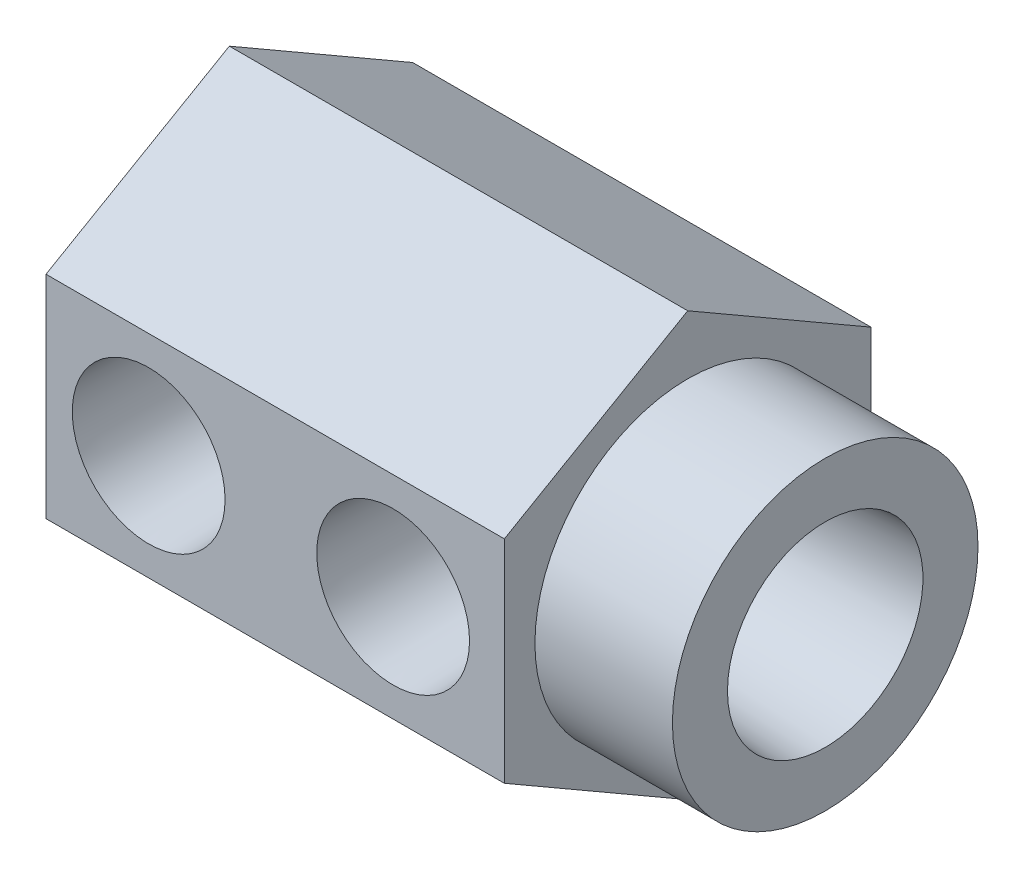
ISO-10303-21;
HEADER;
FILE_DESCRIPTION(('STEP AP214'),'2;1');
FILE_NAME('part.step','',(''),(''),'','','');
FILE_SCHEMA(('AUTOMOTIVE_DESIGN { 1 0 10303 214 1 1 1 1 }'));
ENDSEC;
DATA;
#1=APPLICATION_CONTEXT('core data for automotive mechanical design processes');
#2=APPLICATION_PROTOCOL_DEFINITION('international standard','automotive_design',2000,#1);
#3=PRODUCT_CONTEXT('',#1,'mechanical');
#4=PRODUCT('Part','Part','',(#3));
#5=PRODUCT_RELATED_PRODUCT_CATEGORY('part','',(#4));
#6=PRODUCT_DEFINITION_FORMATION('','',#4);
#7=PRODUCT_DEFINITION_CONTEXT('part definition',#1,'design');
#8=PRODUCT_DEFINITION('design','',#6,#7);
#9=PRODUCT_DEFINITION_SHAPE('','',#8);
#10=(LENGTH_UNIT() NAMED_UNIT(*) SI_UNIT(.MILLI.,.METRE.));
#11=(NAMED_UNIT(*) PLANE_ANGLE_UNIT() SI_UNIT($,.RADIAN.));
#12=(NAMED_UNIT(*) SI_UNIT($,.STERADIAN.) SOLID_ANGLE_UNIT());
#13=UNCERTAINTY_MEASURE_WITH_UNIT(LENGTH_MEASURE(1.E-05),#10,'distance_accuracy_value','');
#14=(GEOMETRIC_REPRESENTATION_CONTEXT(3) GLOBAL_UNCERTAINTY_ASSIGNED_CONTEXT((#13)) GLOBAL_UNIT_ASSIGNED_CONTEXT((#10,
#11,#12)) REPRESENTATION_CONTEXT('',''));
#15=CARTESIAN_POINT('',(0.,0.,0.));
#16=DIRECTION('',(0.,0.,1.));
#17=DIRECTION('',(1.,0.,0.));
#18=AXIS2_PLACEMENT_3D('',#15,#16,#17);
#19=CARTESIAN_POINT('',(30.95625,0.,0.));
#20=DIRECTION('',(1.,0.,0.));
#21=DIRECTION('',(0.,0.,-1.));
#22=AXIS2_PLACEMENT_3D('',#19,#20,#21);
#23=PLANE('',#22);
#24=CARTESIAN_POINT('',(30.95625,0.,0.));
#25=DIRECTION('',(1.,0.,0.));
#26=DIRECTION('',(0.,0.,-1.));
#27=AXIS2_PLACEMENT_3D('',#24,#25,#26);
#28=CIRCLE('',#27,7.9375);
#29=CARTESIAN_POINT('',(30.95625,0.,-7.9375));
#30=VERTEX_POINT('',#29);
#31=EDGE_CURVE('E529',#30,#30,#28,.T.);
#32=ORIENTED_EDGE('',*,*,#31,.T.);
#33=EDGE_LOOP('',(#32));
#34=FACE_BOUND('',#33,.T.);
#35=CARTESIAN_POINT('',(30.95625,0.,0.));
#36=DIRECTION('',(-1.,0.,0.));
#37=DIRECTION('',(0.,0.,1.));
#38=AXIS2_PLACEMENT_3D('',#35,#36,#37);
#39=CIRCLE('',#38,5.07746);
#40=CARTESIAN_POINT('',(30.95625,0.,5.07746));
#41=VERTEX_POINT('',#40);
#42=EDGE_CURVE('E525',#41,#41,#39,.T.);
#43=ORIENTED_EDGE('',*,*,#42,.T.);
#44=EDGE_LOOP('',(#43));
#45=FACE_BOUND('',#44,.T.);
#46=ADVANCED_FACE('F35',(#34,#45),#23,.T.);
#47=CARTESIAN_POINT('',(23.8125,-5.4992613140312,-9.525));
#48=DIRECTION('',(1.,0.,0.));
#49=DIRECTION('',(0.,0.,-1.));
#50=AXIS2_PLACEMENT_3D('',#47,#48,#49);
#51=PLANE('',#50);
#52=DIRECTION('',(0.,0.5,-0.866025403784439));
#53=VECTOR('',#52,1.);
#54=CARTESIAN_POINT('',(23.8125,-10.9985226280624,0.));
#55=LINE('',#54,#53);
#56=CARTESIAN_POINT('',(23.8125,-10.9985226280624,0.));
#57=VERTEX_POINT('',#56);
#58=CARTESIAN_POINT('',(23.8125,-5.49926131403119,-9.525));
#59=VERTEX_POINT('',#58);
#60=EDGE_CURVE('E477',#57,#59,#55,.T.);
#61=ORIENTED_EDGE('',*,*,#60,.T.);
#62=DIRECTION('',(0.,1.,0.));
#63=VECTOR('',#62,1.);
#64=CARTESIAN_POINT('',(23.8125,-5.49926131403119,-9.525));
#65=LINE('',#64,#63);
#66=CARTESIAN_POINT('',(23.8125,5.49926131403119,-9.525));
#67=VERTEX_POINT('',#66);
#68=EDGE_CURVE('E535',#59,#67,#65,.T.);
#69=ORIENTED_EDGE('',*,*,#68,.T.);
#70=DIRECTION('',(0.,0.5,0.866025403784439));
#71=VECTOR('',#70,1.);
#72=CARTESIAN_POINT('',(23.8125,5.49926131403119,-9.525));
#73=LINE('',#72,#71);
#74=CARTESIAN_POINT('',(23.8125,10.9985226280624,0.));
#75=VERTEX_POINT('',#74);
#76=EDGE_CURVE('E463',#67,#75,#73,.T.);
#77=ORIENTED_EDGE('',*,*,#76,.T.);
#78=DIRECTION('',(0.,-0.5,0.866025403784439));
#79=VECTOR('',#78,1.);
#80=CARTESIAN_POINT('',(23.8125,10.9985226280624,0.));
#81=LINE('',#80,#79);
#82=CARTESIAN_POINT('',(23.8125,5.49926131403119,9.52500000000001));
#83=VERTEX_POINT('',#82);
#84=EDGE_CURVE('E538',#75,#83,#81,.T.);
#85=ORIENTED_EDGE('',*,*,#84,.T.);
#86=DIRECTION('',(0.,-1.,0.));
#87=VECTOR('',#86,1.);
#88=CARTESIAN_POINT('',(23.8125,5.49926131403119,9.52500000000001));
#89=LINE('',#88,#87);
#90=CARTESIAN_POINT('',(23.8125,-5.49926131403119,9.52500000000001));
#91=VERTEX_POINT('',#90);
#92=EDGE_CURVE('E540',#83,#91,#89,.T.);
#93=ORIENTED_EDGE('',*,*,#92,.T.);
#94=DIRECTION('',(0.,-0.5,-0.866025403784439));
#95=VECTOR('',#94,1.);
#96=CARTESIAN_POINT('',(23.8125,-5.49926131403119,9.52500000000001));
#97=LINE('',#96,#95);
#98=EDGE_CURVE('E482',#91,#57,#97,.T.);
#99=ORIENTED_EDGE('',*,*,#98,.T.);
#100=EDGE_LOOP('',(#61,#69,#77,#85,#93,#99));
#101=FACE_BOUND('',#100,.T.);
#102=CARTESIAN_POINT('',(23.8125,0.,0.));
#103=DIRECTION('',(1.,0.,0.));
#104=DIRECTION('',(0.,0.,-1.));
#105=AXIS2_PLACEMENT_3D('',#102,#103,#104);
#106=CIRCLE('',#105,7.9375);
#107=CARTESIAN_POINT('',(23.8125,0.,-7.9375));
#108=VERTEX_POINT('',#107);
#109=EDGE_CURVE('E528',#108,#108,#106,.T.);
#110=ORIENTED_EDGE('',*,*,#109,.F.);
#111=EDGE_LOOP('',(#110));
#112=FACE_BOUND('',#111,.T.);
#113=ADVANCED_FACE('F402',(#101,#112),#51,.T.);
#114=CARTESIAN_POINT('',(23.8125,-10.9985226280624,0.));
#115=DIRECTION('',(0.,0.866025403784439,0.5));
#116=DIRECTION('',(0.,-0.5,0.866025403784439));
#117=AXIS2_PLACEMENT_3D('',#114,#115,#116);
#118=PLANE('',#117);
#119=DIRECTION('',(0.,0.5,-0.866025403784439));
#120=VECTOR('',#119,1.);
#121=CARTESIAN_POINT('',(0.,-10.9985226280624,0.));
#122=LINE('',#121,#120);
#123=CARTESIAN_POINT('',(0.,-10.9985226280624,0.));
#124=VERTEX_POINT('',#123);
#125=CARTESIAN_POINT('',(0.,-5.49926131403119,-9.525));
#126=VERTEX_POINT('',#125);
#127=EDGE_CURVE('E459',#124,#126,#122,.T.);
#128=ORIENTED_EDGE('',*,*,#127,.T.);
#129=DIRECTION('',(-1.,0.,0.));
#130=VECTOR('',#129,1.);
#131=CARTESIAN_POINT('',(23.8125,-5.49926131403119,-9.525));
#132=LINE('',#131,#130);
#133=EDGE_CURVE('E454',#59,#126,#132,.T.);
#134=ORIENTED_EDGE('',*,*,#133,.F.);
#135=ORIENTED_EDGE('',*,*,#60,.F.);
#136=DIRECTION('',(-1.,0.,0.));
#137=VECTOR('',#136,1.);
#138=CARTESIAN_POINT('',(23.8125,-10.9985226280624,0.));
#139=LINE('',#138,#137);
#140=EDGE_CURVE('E478',#57,#124,#139,.T.);
#141=ORIENTED_EDGE('',*,*,#140,.T.);
#142=EDGE_LOOP('',(#128,#134,#135,#141));
#143=FACE_BOUND('',#142,.T.);
#144=ADVANCED_FACE('F37',(#143),#118,.F.);
#145=CARTESIAN_POINT('',(23.8125,-5.49926131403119,-9.525));
#146=DIRECTION('',(0.,0.,1.));
#147=DIRECTION('',(1.,0.,0.));
#148=AXIS2_PLACEMENT_3D('',#145,#146,#147);
#149=PLANE('',#148);
#150=CARTESIAN_POINT('',(5.334,0.,-9.525));
#151=DIRECTION('',(0.,0.,-1.));
#152=DIRECTION('',(-1.,0.,0.));
#153=AXIS2_PLACEMENT_3D('',#150,#151,#152);
#154=CIRCLE('',#153,3.96875);
#155=CARTESIAN_POINT('',(1.36525,0.,-9.525));
#156=VERTEX_POINT('',#155);
#157=EDGE_CURVE('E259',#156,#156,#154,.T.);
#158=ORIENTED_EDGE('',*,*,#157,.F.);
#159=EDGE_LOOP('',(#158));
#160=FACE_BOUND('',#159,.T.);
#161=DIRECTION('',(0.,1.,0.));
#162=VECTOR('',#161,1.);
#163=CARTESIAN_POINT('',(0.,-5.49926131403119,-9.525));
#164=LINE('',#163,#162);
#165=CARTESIAN_POINT('',(0.,5.49926131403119,-9.525));
#166=VERTEX_POINT('',#165);
#167=EDGE_CURVE('E449',#126,#166,#164,.T.);
#168=ORIENTED_EDGE('',*,*,#167,.T.);
#169=DIRECTION('',(-1.,0.,0.));
#170=VECTOR('',#169,1.);
#171=CARTESIAN_POINT('',(23.8125,5.49926131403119,-9.525));
#172=LINE('',#171,#170);
#173=EDGE_CURVE('E451',#67,#166,#172,.T.);
#174=ORIENTED_EDGE('',*,*,#173,.F.);
#175=ORIENTED_EDGE('',*,*,#68,.F.);
#176=ORIENTED_EDGE('',*,*,#133,.T.);
#177=EDGE_LOOP('',(#168,#174,#175,#176));
#178=FACE_BOUND('',#177,.T.);
#179=ADVANCED_FACE('F436',(#160,#178),#149,.F.);
#180=CARTESIAN_POINT('',(23.8125,5.49926131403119,-9.525));
#181=DIRECTION('',(0.,-0.866025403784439,0.5));
#182=DIRECTION('',(0.,-0.5,-0.866025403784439));
#183=AXIS2_PLACEMENT_3D('',#180,#181,#182);
#184=PLANE('',#183);
#185=DIRECTION('',(0.,0.5,0.866025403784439));
#186=VECTOR('',#185,1.);
#187=CARTESIAN_POINT('',(0.,5.49926131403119,-9.525));
#188=LINE('',#187,#186);
#189=CARTESIAN_POINT('',(0.,10.9985226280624,0.));
#190=VERTEX_POINT('',#189);
#191=EDGE_CURVE('E458',#166,#190,#188,.T.);
#192=ORIENTED_EDGE('',*,*,#191,.T.);
#193=DIRECTION('',(-1.,0.,0.));
#194=VECTOR('',#193,1.);
#195=CARTESIAN_POINT('',(23.8125,10.9985226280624,0.));
#196=LINE('',#195,#194);
#197=EDGE_CURVE('E464',#75,#190,#196,.T.);
#198=ORIENTED_EDGE('',*,*,#197,.F.);
#199=ORIENTED_EDGE('',*,*,#76,.F.);
#200=ORIENTED_EDGE('',*,*,#173,.T.);
#201=EDGE_LOOP('',(#192,#198,#199,#200));
#202=FACE_BOUND('',#201,.T.);
#203=ADVANCED_FACE('F433',(#202),#184,.F.);
#204=CARTESIAN_POINT('',(23.8125,10.9985226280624,0.));
#205=DIRECTION('',(0.,-0.866025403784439,-0.5));
#206=DIRECTION('',(0.,0.5,-0.866025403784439));
#207=AXIS2_PLACEMENT_3D('',#204,#205,#206);
#208=PLANE('',#207);
#209=DIRECTION('',(0.,-0.5,0.866025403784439));
#210=VECTOR('',#209,1.);
#211=CARTESIAN_POINT('',(0.,10.9985226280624,0.));
#212=LINE('',#211,#210);
#213=CARTESIAN_POINT('',(0.,5.49926131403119,9.52500000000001));
#214=VERTEX_POINT('',#213);
#215=EDGE_CURVE('E468',#190,#214,#212,.T.);
#216=ORIENTED_EDGE('',*,*,#215,.T.);
#217=DIRECTION('',(-1.,0.,0.));
#218=VECTOR('',#217,1.);
#219=CARTESIAN_POINT('',(23.8125,5.49926131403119,9.52500000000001));
#220=LINE('',#219,#218);
#221=EDGE_CURVE('E485',#83,#214,#220,.T.);
#222=ORIENTED_EDGE('',*,*,#221,.F.);
#223=ORIENTED_EDGE('',*,*,#84,.F.);
#224=ORIENTED_EDGE('',*,*,#197,.T.);
#225=EDGE_LOOP('',(#216,#222,#223,#224));
#226=FACE_BOUND('',#225,.T.);
#227=ADVANCED_FACE('F429',(#226),#208,.F.);
#228=CARTESIAN_POINT('',(23.8125,5.49926131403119,9.52500000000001));
#229=DIRECTION('',(0.,0.,-1.));
#230=DIRECTION('',(-1.,0.,0.));
#231=AXIS2_PLACEMENT_3D('',#228,#229,#230);
#232=PLANE('',#231);
#233=CARTESIAN_POINT('',(5.334,0.,9.52500000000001));
#234=DIRECTION('',(0.,0.,1.));
#235=DIRECTION('',(1.,0.,0.));
#236=AXIS2_PLACEMENT_3D('',#233,#234,#235);
#237=CIRCLE('',#236,3.96875);
#238=CARTESIAN_POINT('',(9.30275,0.,9.52500000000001));
#239=VERTEX_POINT('',#238);
#240=EDGE_CURVE('E228',#239,#239,#237,.T.);
#241=ORIENTED_EDGE('',*,*,#240,.F.);
#242=EDGE_LOOP('',(#241));
#243=FACE_BOUND('',#242,.T.);
#244=CARTESIAN_POINT('',(18.034,0.,9.52500000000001));
#245=DIRECTION('',(0.,0.,1.));
#246=DIRECTION('',(1.,0.,0.));
#247=AXIS2_PLACEMENT_3D('',#244,#245,#246);
#248=CIRCLE('',#247,3.96875);
#249=CARTESIAN_POINT('',(22.00275,0.,9.52500000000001));
#250=VERTEX_POINT('',#249);
#251=EDGE_CURVE('E237',#250,#250,#248,.T.);
#252=ORIENTED_EDGE('',*,*,#251,.F.);
#253=EDGE_LOOP('',(#252));
#254=FACE_BOUND('',#253,.T.);
#255=DIRECTION('',(0.,-1.,0.));
#256=VECTOR('',#255,1.);
#257=CARTESIAN_POINT('',(0.,5.49926131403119,9.52500000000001));
#258=LINE('',#257,#256);
#259=CARTESIAN_POINT('',(0.,-5.49926131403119,9.52500000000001));
#260=VERTEX_POINT('',#259);
#261=EDGE_CURVE('E470',#214,#260,#258,.T.);
#262=ORIENTED_EDGE('',*,*,#261,.T.);
#263=DIRECTION('',(-1.,0.,0.));
#264=VECTOR('',#263,1.);
#265=CARTESIAN_POINT('',(23.8125,-5.49926131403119,9.52500000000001));
#266=LINE('',#265,#264);
#267=EDGE_CURVE('E481',#91,#260,#266,.T.);
#268=ORIENTED_EDGE('',*,*,#267,.F.);
#269=ORIENTED_EDGE('',*,*,#92,.F.);
#270=ORIENTED_EDGE('',*,*,#221,.T.);
#271=EDGE_LOOP('',(#262,#268,#269,#270));
#272=FACE_BOUND('',#271,.T.);
#273=ADVANCED_FACE('F425',(#243,#254,#272),#232,.F.);
#274=CARTESIAN_POINT('',(23.8125,-5.49926131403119,9.52500000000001));
#275=DIRECTION('',(0.,0.866025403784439,-0.5));
#276=DIRECTION('',(0.,0.5,0.866025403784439));
#277=AXIS2_PLACEMENT_3D('',#274,#275,#276);
#278=PLANE('',#277);
#279=DIRECTION('',(0.,-0.5,-0.866025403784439));
#280=VECTOR('',#279,1.);
#281=CARTESIAN_POINT('',(0.,-5.49926131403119,9.52500000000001));
#282=LINE('',#281,#280);
#283=EDGE_CURVE('E475',#260,#124,#282,.T.);
#284=ORIENTED_EDGE('',*,*,#283,.T.);
#285=ORIENTED_EDGE('',*,*,#140,.F.);
#286=ORIENTED_EDGE('',*,*,#98,.F.);
#287=ORIENTED_EDGE('',*,*,#267,.T.);
#288=EDGE_LOOP('',(#284,#285,#286,#287));
#289=FACE_BOUND('',#288,.T.);
#290=ADVANCED_FACE('F421',(#289),#278,.F.);
#291=CARTESIAN_POINT('',(0.,-5.4992613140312,-9.525));
#292=DIRECTION('',(1.,0.,0.));
#293=DIRECTION('',(0.,0.,-1.));
#294=AXIS2_PLACEMENT_3D('',#291,#292,#293);
#295=PLANE('',#294);
#296=ORIENTED_EDGE('',*,*,#127,.F.);
#297=ORIENTED_EDGE('',*,*,#283,.F.);
#298=ORIENTED_EDGE('',*,*,#261,.F.);
#299=ORIENTED_EDGE('',*,*,#215,.F.);
#300=ORIENTED_EDGE('',*,*,#191,.F.);
#301=ORIENTED_EDGE('',*,*,#167,.F.);
#302=EDGE_LOOP('',(#296,#297,#298,#299,#300,#301));
#303=FACE_BOUND('',#302,.T.);
#304=ADVANCED_FACE('F416',(#303),#295,.F.);
#305=CARTESIAN_POINT('',(30.95625,0.,0.));
#306=DIRECTION('',(-1.,0.,0.));
#307=DIRECTION('',(0.,0.,1.));
#308=AXIS2_PLACEMENT_3D('',#305,#306,#307);
#309=CYLINDRICAL_SURFACE('',#308,7.9375);
#310=ORIENTED_EDGE('',*,*,#31,.F.);
#311=EDGE_LOOP('',(#310));
#312=FACE_BOUND('',#311,.T.);
#313=ORIENTED_EDGE('',*,*,#109,.T.);
#314=EDGE_LOOP('',(#313));
#315=FACE_BOUND('',#314,.T.);
#316=ADVANCED_FACE('F414',(#312,#315),#309,.T.);
#317=CARTESIAN_POINT('',(30.95625,0.,0.));
#318=DIRECTION('',(1.,0.,0.));
#319=DIRECTION('',(0.,0.,-1.));
#320=AXIS2_PLACEMENT_3D('',#317,#318,#319);
#321=CONICAL_SURFACE('',#320,5.07746,0.0523598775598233);
#322=CARTESIAN_POINT('',(23.97125,0.,0.));
#323=DIRECTION('',(-1.,0.,0.));
#324=DIRECTION('',(0.,0.,1.));
#325=AXIS2_PLACEMENT_3D('',#322,#323,#324);
#326=CIRCLE('',#325,4.711391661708);
#327=CARTESIAN_POINT('',(23.97125,0.,4.711391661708));
#328=VERTEX_POINT('',#327);
#329=EDGE_CURVE('E519',#328,#328,#326,.T.);
#330=ORIENTED_EDGE('',*,*,#329,.T.);
#331=EDGE_LOOP('',(#330));
#332=FACE_BOUND('',#331,.T.);
#333=ORIENTED_EDGE('',*,*,#42,.F.);
#334=EDGE_LOOP('',(#333));
#335=FACE_BOUND('',#334,.T.);
#336=ADVANCED_FACE('F413',(#332,#335),#321,.F.);
#337=CARTESIAN_POINT('',(23.97125,0.,-3.41629999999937));
#338=DIRECTION('',(1.,0.,0.));
#339=DIRECTION('',(0.,0.,-1.));
#340=AXIS2_PLACEMENT_3D('',#337,#338,#339);
#341=PLANE('',#340);
#342=CARTESIAN_POINT('',(23.97125,0.,0.));
#343=DIRECTION('',(-1.,0.,0.));
#344=DIRECTION('',(0.,0.,1.));
#345=AXIS2_PLACEMENT_3D('',#342,#343,#344);
#346=CIRCLE('',#345,3.41629999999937);
#347=CARTESIAN_POINT('',(23.97125,0.,3.41629999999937));
#348=VERTEX_POINT('',#347);
#349=EDGE_CURVE('E515',#348,#348,#346,.T.);
#350=ORIENTED_EDGE('',*,*,#349,.T.);
#351=EDGE_LOOP('',(#350));
#352=FACE_BOUND('',#351,.T.);
#353=ORIENTED_EDGE('',*,*,#329,.F.);
#354=EDGE_LOOP('',(#353));
#355=FACE_BOUND('',#354,.T.);
#356=ADVANCED_FACE('F315',(#352,#355),#341,.T.);
#357=CARTESIAN_POINT('',(-5.61637673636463,0.,0.));
#358=DIRECTION('',(-1.,0.,0.));
#359=DIRECTION('',(0.,0.,1.));
#360=AXIS2_PLACEMENT_3D('',#357,#358,#359);
#361=CYLINDRICAL_SURFACE('',#360,3.41629999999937);
#362=CARTESIAN_POINT('',(21.1074,0.,-3.41629999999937));
#363=CARTESIAN_POINT('',(21.1073906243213,0.142457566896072,-3.41629074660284));
#364=CARTESIAN_POINT('',(21.0974162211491,0.284993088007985,-3.40730981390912));
#365=CARTESIAN_POINT('',(21.0582943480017,0.56526004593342,-3.37218076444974));
#366=CARTESIAN_POINT('',(21.0291272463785,0.702986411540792,-3.34601506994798));
#367=CARTESIAN_POINT('',(20.9539481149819,0.968849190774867,-3.27889164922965));
#368=CARTESIAN_POINT('',(20.9080443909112,1.09704102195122,-3.23802905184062));
#369=CARTESIAN_POINT('',(20.8019209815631,1.34250340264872,-3.14421552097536));
#370=CARTESIAN_POINT('',(20.7416960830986,1.45976995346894,-3.09126018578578));
#371=CARTESIAN_POINT('',(20.5830972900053,1.72643638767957,-2.95315649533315));
#372=CARTESIAN_POINT('',(20.4790627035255,1.87015856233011,-2.86356607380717));
#373=CARTESIAN_POINT('',(20.2527087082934,2.13388777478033,-2.67286201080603));
#374=CARTESIAN_POINT('',(20.1303443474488,2.25383477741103,-2.57172018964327));
#375=CARTESIAN_POINT('',(19.9338160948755,2.41742888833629,-2.41516689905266));
#376=CARTESIAN_POINT('',(19.865262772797,2.46975022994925,-2.36151942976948));
#377=CARTESIAN_POINT('',(19.7241991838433,2.56835019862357,-2.25388595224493));
#378=CARTESIAN_POINT('',(19.6516899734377,2.61463042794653,-2.19990003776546));
#379=CARTESIAN_POINT('',(19.5027314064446,2.70111536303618,-2.09279951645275));
#380=CARTESIAN_POINT('',(19.426288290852,2.7413293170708,-2.03968369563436));
#381=CARTESIAN_POINT('',(19.2690478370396,2.81567123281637,-1.93576189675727));
#382=CARTESIAN_POINT('',(19.1882533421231,2.84980310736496,-1.88495444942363));
#383=CARTESIAN_POINT('',(19.0219129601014,2.91164408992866,-1.78793937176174));
#384=CARTESIAN_POINT('',(18.9363825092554,2.93937269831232,-1.74171802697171));
#385=CARTESIAN_POINT('',(18.7596212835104,2.98791621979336,-1.65705658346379));
#386=CARTESIAN_POINT('',(18.6683962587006,3.0087379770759,-1.61860879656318));
#387=CARTESIAN_POINT('',(18.4959301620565,3.03952516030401,-1.55990772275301));
#388=CARTESIAN_POINT('',(18.4156107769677,3.05073125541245,-1.53767680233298));
#389=CARTESIAN_POINT('',(18.2520056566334,3.06675275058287,-1.50548144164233));
#390=CARTESIAN_POINT('',(18.1687284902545,3.0715852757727,-1.4954841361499));
#391=CARTESIAN_POINT('',(18.0010923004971,3.07437135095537,-1.48975286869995));
#392=CARTESIAN_POINT('',(17.9167298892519,3.07228853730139,-1.49409430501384));
#393=CARTESIAN_POINT('',(17.7501821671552,3.06141172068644,-1.51624518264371));
#394=CARTESIAN_POINT('',(17.6680020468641,3.05260298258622,-1.53408419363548));
#395=CARTESIAN_POINT('',(17.4729486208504,3.02398919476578,-1.58994377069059));
#396=CARTESIAN_POINT('',(17.3621398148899,3.00107873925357,-1.63335206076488));
#397=CARTESIAN_POINT('',(17.1485749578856,2.94518173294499,-1.73212104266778));
#398=CARTESIAN_POINT('',(17.0458550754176,2.91215283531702,-1.78753167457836));
#399=CARTESIAN_POINT('',(16.8549976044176,2.83995043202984,-1.89998166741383));
#400=CARTESIAN_POINT('',(16.7663447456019,2.80143104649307,-1.95658047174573));
#401=CARTESIAN_POINT('',(16.5942445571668,2.71699966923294,-2.07223389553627));
#402=CARTESIAN_POINT('',(16.5108012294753,2.67108208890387,-2.13129034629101));
#403=CARTESIAN_POINT('',(16.3488100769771,2.57195064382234,-2.24992301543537));
#404=CARTESIAN_POINT('',(16.2702606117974,2.51873924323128,-2.30949905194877));
#405=CARTESIAN_POINT('',(16.1179919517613,2.40493916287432,-2.42778009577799));
#406=CARTESIAN_POINT('',(16.0442737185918,2.34434902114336,-2.486484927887));
#407=CARTESIAN_POINT('',(15.8513952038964,2.17001201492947,-2.64271694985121));
#408=CARTESIAN_POINT('',(15.7370373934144,2.04901466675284,-2.73828635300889));
#409=CARTESIAN_POINT('',(15.5262353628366,1.78474938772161,-2.91739010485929));
#410=CARTESIAN_POINT('',(15.4297539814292,1.64152882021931,-3.00094933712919));
#411=CARTESIAN_POINT('',(15.2789335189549,1.36887485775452,-3.13284294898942));
#412=CARTESIAN_POINT('',(15.2200027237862,1.2437766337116,-3.18486295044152));
#413=CARTESIAN_POINT('',(15.1184268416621,0.982245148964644,-3.27495514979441));
#414=CARTESIAN_POINT('',(15.0757725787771,0.845818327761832,-3.31303520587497));
#415=CARTESIAN_POINT('',(15.0259678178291,0.634703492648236,-3.35760685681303));
#416=CARTESIAN_POINT('',(15.0116986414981,0.562929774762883,-3.37040024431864));
#417=CARTESIAN_POINT('',(14.9882617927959,0.417909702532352,-3.39143210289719));
#418=CARTESIAN_POINT('',(14.9790916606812,0.344664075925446,-3.39967277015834));
#419=CARTESIAN_POINT('',(14.9660509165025,0.197338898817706,-3.41139583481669));
#420=CARTESIAN_POINT('',(14.9621790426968,0.123259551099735,-3.41487936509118));
#421=CARTESIAN_POINT('',(14.9598058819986,-0.0250305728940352,-3.41701450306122));
#422=CARTESIAN_POINT('',(14.961304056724,-0.0992413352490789,-3.41566659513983));
#423=CARTESIAN_POINT('',(14.9728587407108,-0.303677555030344,-3.40527356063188));
#424=CARTESIAN_POINT('',(14.988577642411,-0.433397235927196,-3.39113605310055));
#425=CARTESIAN_POINT('',(15.0356843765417,-0.687487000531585,-3.34889668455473));
#426=CARTESIAN_POINT('',(15.0670744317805,-0.811856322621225,-3.32079284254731));
#427=CARTESIAN_POINT('',(15.1447062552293,-1.055723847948,-3.25161743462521));
#428=CARTESIAN_POINT('',(15.1913035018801,-1.17501935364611,-3.21023592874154));
#429=CARTESIAN_POINT('',(15.2969019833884,-1.4035545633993,-3.1171157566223));
#430=CARTESIAN_POINT('',(15.3559084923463,-1.51278996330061,-3.06537268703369));
#431=CARTESIAN_POINT('',(15.5164413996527,-1.77233980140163,-2.92593514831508));
#432=CARTESIAN_POINT('',(15.6244943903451,-1.91596062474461,-2.83318323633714));
#433=CARTESIAN_POINT('',(15.8002449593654,-2.11279907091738,-2.68588349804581));
#434=CARTESIAN_POINT('',(15.8612383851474,-2.17541615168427,-2.63531576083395));
#435=CARTESIAN_POINT('',(15.9874380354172,-2.29453449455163,-2.53227207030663));
#436=CARTESIAN_POINT('',(16.0526427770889,-2.35103789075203,-2.47979679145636));
#437=CARTESIAN_POINT('',(16.1885856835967,-2.45926087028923,-2.37256880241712));
#438=CARTESIAN_POINT('',(16.2594176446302,-2.51083752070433,-2.31779153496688));
#439=CARTESIAN_POINT('',(16.4051624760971,-2.60774464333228,-2.20819337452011));
#440=CARTESIAN_POINT('',(16.480074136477,-2.653076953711,-2.1533724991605));
#441=CARTESIAN_POINT('',(16.6340283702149,-2.73743692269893,-2.04505374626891));
#442=CARTESIAN_POINT('',(16.7130627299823,-2.77647652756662,-1.99155352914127));
#443=CARTESIAN_POINT('',(16.8757896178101,-2.84819921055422,-1.88755018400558));
#444=CARTESIAN_POINT('',(16.9594781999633,-2.88088757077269,-1.83704458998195));
#445=CARTESIAN_POINT('',(17.127249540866,-2.93785270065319,-1.74439302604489));
#446=CARTESIAN_POINT('',(17.2110250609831,-2.96250867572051,-1.70193139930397));
#447=CARTESIAN_POINT('',(17.3839551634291,-3.00518460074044,-1.62538880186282));
#448=CARTESIAN_POINT('',(17.4731014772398,-3.02321446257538,-1.59129533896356));
#449=CARTESIAN_POINT('',(17.6419171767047,-3.04928140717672,-1.54067461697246));
#450=CARTESIAN_POINT('',(17.720803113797,-3.058459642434,-1.52220345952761));
#451=CARTESIAN_POINT('',(17.8808819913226,-3.07062681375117,-1.49751869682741));
#452=CARTESIAN_POINT('',(17.9620695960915,-3.07362903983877,-1.4912787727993));
#453=CARTESIAN_POINT('',(18.1245222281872,-3.07314284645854,-1.49227919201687));
#454=CARTESIAN_POINT('',(18.2057870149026,-3.06963972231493,-1.49955007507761));
#455=CARTESIAN_POINT('',(18.3658523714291,-3.05649264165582,-1.52616057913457));
#456=CARTESIAN_POINT('',(18.4446471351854,-3.0468352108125,-1.54552667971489));
#457=CARTESIAN_POINT('',(18.6411074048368,-3.01527767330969,-1.60652028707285));
#458=CARTESIAN_POINT('',(18.7561047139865,-2.98955853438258,-1.65453716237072));
#459=CARTESIAN_POINT('',(18.9774267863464,-2.92729500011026,-1.76237184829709));
#460=CARTESIAN_POINT('',(19.0837112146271,-2.8907035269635,-1.82224059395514));
#461=CARTESIAN_POINT('',(19.278873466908,-2.81176552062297,-1.94157617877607));
#462=CARTESIAN_POINT('',(19.3684410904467,-2.77031588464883,-2.00052360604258));
#463=CARTESIAN_POINT('',(19.5422377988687,-2.67966824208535,-2.12041024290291));
#464=CARTESIAN_POINT('',(19.6264630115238,-2.63046470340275,-2.18135084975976));
#465=CARTESIAN_POINT('',(19.7897700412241,-2.52438599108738,-2.30328258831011));
#466=CARTESIAN_POINT('',(19.8688559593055,-2.46751704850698,-2.36427363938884));
#467=CARTESIAN_POINT('',(20.0218913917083,-2.34597990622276,-2.48491905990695));
#468=CARTESIAN_POINT('',(20.0958401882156,-2.28131062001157,-2.54457324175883));
#469=CARTESIAN_POINT('',(20.2819798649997,-2.1018729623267,-2.69710341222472));
#470=CARTESIAN_POINT('',(20.3898225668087,-1.98069618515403,-2.7879259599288));
#471=CARTESIAN_POINT('',(20.5880588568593,-1.71744050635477,-2.95735105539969));
#472=CARTESIAN_POINT('',(20.6784836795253,-1.57539984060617,-3.03597542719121));
#473=CARTESIAN_POINT('',(20.8203169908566,-1.3039919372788,-3.16037812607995));
#474=CARTESIAN_POINT('',(20.8759338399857,-1.17841159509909,-3.20958492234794));
#475=CARTESIAN_POINT('',(20.9707669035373,-0.916765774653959,-3.29384915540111));
#476=CARTESIAN_POINT('',(21.0100080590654,-0.780716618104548,-3.32892810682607));
#477=CARTESIAN_POINT('',(21.0620001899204,-0.536986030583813,-3.37550132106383));
#478=CARTESIAN_POINT('',(21.0789513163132,-0.430897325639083,-3.39072586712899));
#479=CARTESIAN_POINT('',(21.1016550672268,-0.216554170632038,-3.41112897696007));
#480=CARTESIAN_POINT('',(21.1074071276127,-0.108299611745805,-3.41630703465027));
#481=CARTESIAN_POINT('',(21.1074,0.,-3.41629999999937));
#482=B_SPLINE_CURVE_WITH_KNOTS('',3,(#362,#363,#364,#365,#366,#367,#368,#369,#370,#371,#372,
#373,#374,#375,#376,#377,#378,#379,#380,#381,#382,#383,#384,#385,#386,#387,#388,#389,#390,#391,
#392,#393,#394,#395,#396,#397,#398,#399,#400,#401,#402,#403,#404,#405,#406,#407,#408,#409,#410,
#411,#412,#413,#414,#415,#416,#417,#418,#419,#420,#421,#422,#423,#424,#425,#426,#427,#428,#429,
#430,#431,#432,#433,#434,#435,#436,#437,#438,#439,#440,#441,#442,#443,#444,#445,#446,#447,#448,
#449,#450,#451,#452,#453,#454,#455,#456,#457,#458,#459,#460,#461,#462,#463,#464,#465,#466,#467,
#468,#469,#470,#471,#472,#473,#474,#475,#476,#477,#478,#479,#480,#481),.UNSPECIFIED.,.T.,.F.,(4,
2,2,2,2,2,2,2,2,2,2,2,2,2,2,2,2,2,2,2,2,2,2,2,2,2,2,2,2,2,2,2,2,2,2,2,2,2,2,2,2,2,2,2,2,2,2,2,2,
2,2,2,2,2,2,2,2,2,2,4),(0.,0.426905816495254,0.854248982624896,1.27887444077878,1.7036547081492,
2.29674049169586,2.89130532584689,3.19578881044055,3.50019137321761,3.80412506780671,
4.10786251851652,4.41066240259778,4.71316133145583,4.96448724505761,5.21513648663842,
5.46710582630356,5.71962876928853,6.08116121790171,6.4442278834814,6.77982012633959,
7.11566707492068,7.45140083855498,7.78720123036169,8.36088009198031,8.93335267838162,
9.37493030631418,9.8162586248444,10.0388467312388,10.2613273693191,10.4837550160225,
10.7061603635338,11.0984232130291,11.4907417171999,11.8929806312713,12.2953908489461,
12.8985583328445,13.201316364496,13.5039683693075,13.8137045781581,14.1233494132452,
14.4323993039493,14.7411910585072,15.0319860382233,15.3223442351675,15.5659778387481,
15.8090866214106,16.0527455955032,16.2969398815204,16.6765146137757,17.0577574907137,
17.4021870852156,17.7468635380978,18.0912614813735,18.4357074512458,18.9913179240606,
19.5459225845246,19.9819097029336,20.4172303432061,20.7417578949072,21.0663017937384),.UNSPECIFIED.);
#483=CARTESIAN_POINT('',(21.1074,0.,-3.41629999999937));
#484=VERTEX_POINT('',#483);
#485=EDGE_CURVE('E307',#484,#484,#482,.T.);
#486=ORIENTED_EDGE('',*,*,#485,.F.);
#487=EDGE_LOOP('',(#486));
#488=FACE_BOUND('',#487,.T.);
#489=CARTESIAN_POINT('',(14.9600111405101,-2.16968283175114,2.63886000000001));
#490=CARTESIAN_POINT('',(14.9150189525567,-2.10853489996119,2.68912119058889));
#491=CARTESIAN_POINT('',(14.8712851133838,-2.04512144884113,2.73770979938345));
#492=CARTESIAN_POINT('',(14.7867636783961,-1.91360919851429,2.83121060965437));
#493=CARTESIAN_POINT('',(14.7459805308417,-1.84550361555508,2.87611727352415));
#494=CARTESIAN_POINT('',(14.6308304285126,-1.63768444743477,3.00247948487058));
#495=CARTESIAN_POINT('',(14.5613875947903,-1.4914374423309,3.07810382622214));
#496=CARTESIAN_POINT('',(14.462957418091,-1.24045751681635,3.18488334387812));
#497=CARTESIAN_POINT('',(14.4285115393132,-1.14040554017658,3.22213569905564));
#498=CARTESIAN_POINT('',(14.3673839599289,-0.933479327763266,3.28811991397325));
#499=CARTESIAN_POINT('',(14.3408265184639,-0.826525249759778,3.31671553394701));
#500=CARTESIAN_POINT('',(14.31905,-0.71730556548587,3.34014646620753));
#501=B_SPLINE_CURVE_WITH_KNOTS('',3,(#489,#490,#491,#492,#493,#494,#495,#496,#497,#498,#499,
#500),.UNSPECIFIED.,.F.,.F.,(4,2,2,2,2,4),(0.,0.273021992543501,0.546447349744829,
1.07976341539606,1.41559322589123,1.75646224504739),.UNSPECIFIED.);
#502=CARTESIAN_POINT('',(14.9598321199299,-2.16943956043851,2.63906000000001));
#503=VERTEX_POINT('',#502);
#504=CARTESIAN_POINT('',(14.31925,-0.718306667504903,3.33993131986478));
#505=VERTEX_POINT('',#504);
#506=EDGE_CURVE('E295',#503,#505,#501,.T.);
#507=ORIENTED_EDGE('',*,*,#506,.F.);
#508=DIRECTION('',(-1.,0.,0.));
#509=VECTOR('',#508,1.);
#510=CARTESIAN_POINT('',(-5.61637673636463,-2.16943956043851,2.63906000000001));
#511=LINE('',#510,#509);
#512=CARTESIAN_POINT('',(15.8570021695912,-2.16943956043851,2.63906000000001));
#513=VERTEX_POINT('',#512);
#514=EDGE_CURVE('E302',#513,#503,#511,.T.);
#515=ORIENTED_EDGE('',*,*,#514,.F.);
#516=CARTESIAN_POINT('',(20.2109978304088,-2.16943956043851,2.63906000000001));
#517=CARTESIAN_POINT('',(20.1714390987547,-2.20913157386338,2.60643078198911));
#518=CARTESIAN_POINT('',(20.1309974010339,-2.24754794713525,2.57334996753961));
#519=CARTESIAN_POINT('',(20.0484095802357,-2.32185933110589,2.50650631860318));
#520=CARTESIAN_POINT('',(20.006263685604,-2.35775467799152,2.47274357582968));
#521=CARTESIAN_POINT('',(19.8771442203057,-2.46188193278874,2.37059140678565));
#522=CARTESIAN_POINT('',(19.7876748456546,-2.52636926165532,2.30149304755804));
#523=CARTESIAN_POINT('',(19.6003931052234,-2.64666702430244,2.16215138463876));
#524=CARTESIAN_POINT('',(19.5024493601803,-2.70227739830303,2.09191292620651));
#525=CARTESIAN_POINT('',(19.2993704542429,-2.80311808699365,1.95469595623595));
#526=CARTESIAN_POINT('',(19.1942473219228,-2.84836523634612,1.88771229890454));
#527=CARTESIAN_POINT('',(19.0022026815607,-2.91823431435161,1.77713104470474));
#528=CARTESIAN_POINT('',(18.9171298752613,-2.94519355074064,1.73182401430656));
#529=CARTESIAN_POINT('',(18.7415661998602,-2.99221635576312,1.6492389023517));
#530=CARTESIAN_POINT('',(18.6510955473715,-3.01230396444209,1.611933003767));
#531=CARTESIAN_POINT('',(18.479793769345,-3.04192325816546,1.55520804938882));
#532=CARTESIAN_POINT('',(18.399836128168,-3.05264996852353,1.53385305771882));
#533=CARTESIAN_POINT('',(18.2371057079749,-3.06776305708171,1.50341003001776));
#534=CARTESIAN_POINT('',(18.1543407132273,-3.07216570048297,1.49429052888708));
#535=CARTESIAN_POINT('',(17.9879763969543,-3.07418502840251,1.49013496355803));
#536=CARTESIAN_POINT('',(17.9043749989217,-3.07177123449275,1.49516215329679));
#537=CARTESIAN_POINT('',(17.7394069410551,-3.06037271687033,1.51834630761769));
#538=CARTESIAN_POINT('',(17.6580460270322,-3.05137248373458,1.53653426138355));
#539=CARTESIAN_POINT('',(17.462793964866,-3.02212841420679,1.59350200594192));
#540=CARTESIAN_POINT('',(17.3510982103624,-2.99862096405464,1.63790025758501));
#541=CARTESIAN_POINT('',(17.1358591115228,-2.94136683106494,1.738631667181));
#542=CARTESIAN_POINT('',(17.0323554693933,-2.90757372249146,1.79501858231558));
#543=CARTESIAN_POINT('',(16.8403729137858,-2.83385543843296,1.90909274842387));
#544=CARTESIAN_POINT('',(16.751352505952,-2.79462108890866,1.96632937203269));
#545=CARTESIAN_POINT('',(16.5785511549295,-2.70864872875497,2.08316986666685));
#546=CARTESIAN_POINT('',(16.4947748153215,-2.66190425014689,2.14277574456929));
#547=CARTESIAN_POINT('',(16.3323908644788,-2.56113540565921,2.26225314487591));
#548=CARTESIAN_POINT('',(16.2537693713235,-2.50713189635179,2.32212344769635));
#549=CARTESIAN_POINT('',(16.101425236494,-2.39166656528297,2.44087942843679));
#550=CARTESIAN_POINT('',(16.0277008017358,-2.3302074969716,2.49976546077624));
#551=CARTESIAN_POINT('',(15.9396834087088,-2.2494778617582,2.57126127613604));
#552=CARTESIAN_POINT('',(15.9229307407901,-2.23376438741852,2.58492578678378));
#553=CARTESIAN_POINT('',(15.8897359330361,-2.20191915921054,2.61210550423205));
#554=CARTESIAN_POINT('',(15.8732935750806,-2.18578771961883,2.62562081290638));
#555=CARTESIAN_POINT('',(15.8570021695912,-2.16943956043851,2.63906000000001));
#556=B_SPLINE_CURVE_WITH_KNOTS('',3,(#516,#517,#518,#519,#520,#521,#522,#523,#524,#525,#526,
#527,#528,#529,#530,#531,#532,#533,#534,#535,#536,#537,#538,#539,#540,#541,#542,#543,#544,#545,
#546,#547,#548,#549,#550,#551,#552,#553,#554,#555),.UNSPECIFIED.,.F.,.F.,(4,2,2,2,2,2,2,2,2,2,2,
2,2,2,2,2,2,2,2,4),(0.,0.194491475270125,0.388956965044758,0.778799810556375,1.17646468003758,
1.57347890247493,1.87324748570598,2.17195635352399,2.42136433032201,2.67012968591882,
2.92000910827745,3.17047883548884,3.53582839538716,3.90285210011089,4.24102539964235,
4.57949152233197,4.9170051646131,5.25439453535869,5.33456943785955,5.41468571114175),.UNSPECIFIED.);
#557=CARTESIAN_POINT('',(20.2109978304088,-2.16943956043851,2.63906000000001));
#558=VERTEX_POINT('',#557);
#559=EDGE_CURVE('E303',#558,#513,#556,.T.);
#560=ORIENTED_EDGE('',*,*,#559,.F.);
#561=CARTESIAN_POINT('',(21.1081678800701,-2.16943956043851,2.63906000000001));
#562=VERTEX_POINT('',#561);
#563=EDGE_CURVE('E494',#562,#558,#511,.T.);
#564=ORIENTED_EDGE('',*,*,#563,.F.);
#565=CARTESIAN_POINT('',(21.1079888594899,2.16968283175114,2.63886000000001));
#566=CARTESIAN_POINT('',(21.1520619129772,2.10978059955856,2.68809472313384));
#567=CARTESIAN_POINT('',(21.1949245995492,2.04771437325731,2.73572086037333));
#568=CARTESIAN_POINT('',(21.277820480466,1.91910612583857,2.82743992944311));
#569=CARTESIAN_POINT('',(21.3178504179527,1.85255911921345,2.87152880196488));
#570=CARTESIAN_POINT('',(21.43365387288,1.64488764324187,2.99864636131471));
#571=CARTESIAN_POINT('',(21.5042906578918,1.49686045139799,3.07558131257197));
#572=CARTESIAN_POINT('',(21.5965672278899,1.26231099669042,3.1756909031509));
#573=CARTESIAN_POINT('',(21.6251366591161,1.18167944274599,3.20660868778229));
#574=CARTESIAN_POINT('',(21.676992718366,1.01679743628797,3.26263564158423));
#575=CARTESIAN_POINT('',(21.7002826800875,0.932549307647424,3.28774847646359));
#576=CARTESIAN_POINT('',(21.7409398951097,0.761401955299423,3.33153788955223));
#577=CARTESIAN_POINT('',(21.7583319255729,0.674515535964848,3.35024139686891));
#578=CARTESIAN_POINT('',(21.7868650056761,0.498555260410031,3.38090469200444));
#579=CARTESIAN_POINT('',(21.7980075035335,0.409481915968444,3.39286604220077));
#580=CARTESIAN_POINT('',(21.8125733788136,0.243238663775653,3.40849786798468));
#581=CARTESIAN_POINT('',(21.8168878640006,0.166234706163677,3.41312559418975));
#582=CARTESIAN_POINT('',(21.8206404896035,0.0119430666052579,3.41715078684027));
#583=CARTESIAN_POINT('',(21.8200770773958,-0.0653446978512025,3.41654658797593));
#584=CARTESIAN_POINT('',(21.8140798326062,-0.219500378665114,3.4101133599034));
#585=CARTESIAN_POINT('',(21.8086468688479,-0.296368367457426,3.40428526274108));
#586=CARTESIAN_POINT('',(21.7930369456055,-0.449069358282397,3.38752932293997));
#587=CARTESIAN_POINT('',(21.7828581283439,-0.524901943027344,3.37659948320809));
#588=CARTESIAN_POINT('',(21.7475961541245,-0.737278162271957,3.33870233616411));
#589=CARTESIAN_POINT('',(21.7171545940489,-0.871970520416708,3.30595350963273));
#590=CARTESIAN_POINT('',(21.6428817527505,-1.13313444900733,3.22581326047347));
#591=CARTESIAN_POINT('',(21.5990255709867,-1.25959019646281,3.17839460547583));
#592=CARTESIAN_POINT('',(21.4895347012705,-1.52855418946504,3.0595117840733));
#593=CARTESIAN_POINT('',(21.4212452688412,-1.66867331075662,2.98507023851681));
#594=CARTESIAN_POINT('',(21.3097598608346,-1.86614519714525,2.86262107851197));
#595=CARTESIAN_POINT('',(21.2711796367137,-1.92973148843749,2.82010703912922));
#596=CARTESIAN_POINT('',(21.1914307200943,-2.05277064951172,2.73183852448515));
#597=CARTESIAN_POINT('',(21.1502650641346,-2.11222820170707,2.68608784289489));
#598=CARTESIAN_POINT('',(21.1079888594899,-2.16968283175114,2.63886000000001));
#599=B_SPLINE_CURVE_WITH_KNOTS('',3,(#565,#566,#567,#568,#569,#570,#571,#572,#573,#574,#575,
#576,#577,#578,#579,#580,#581,#582,#583,#584,#585,#586,#587,#588,#589,#590,#591,#592,#593,#594,
#595,#596,#597,#598),.UNSPECIFIED.,.F.,.F.,(4,2,2,2,2,2,2,2,2,2,2,2,2,2,2,2,4),(0.,
0.267435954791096,0.535174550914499,1.07570322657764,1.34825580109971,1.62063579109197,
1.89185691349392,2.16301515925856,2.39448525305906,2.62602902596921,2.85753149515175,
3.08912466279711,3.51294151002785,3.93754988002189,4.45339356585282,4.71024270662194,
4.96679562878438),.UNSPECIFIED.);
#600=CARTESIAN_POINT('',(21.1081678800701,2.16943956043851,2.63906000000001));
#601=VERTEX_POINT('',#600);
#602=EDGE_CURVE('E288',#601,#562,#599,.T.);
#603=ORIENTED_EDGE('',*,*,#602,.F.);
#604=DIRECTION('',(-1.,0.,0.));
#605=VECTOR('',#604,1.);
#606=CARTESIAN_POINT('',(-5.61637673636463,2.16943956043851,2.63906000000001));
#607=LINE('',#606,#605);
#608=CARTESIAN_POINT('',(20.2109978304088,2.16943956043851,2.63906000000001));
#609=VERTEX_POINT('',#608);
#610=EDGE_CURVE('E327',#609,#601,#607,.F.);
#611=ORIENTED_EDGE('',*,*,#610,.F.);
#612=CARTESIAN_POINT('',(15.8570021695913,2.16943956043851,2.63906000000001));
#613=CARTESIAN_POINT('',(15.8965609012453,2.20913157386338,2.60643078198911));
#614=CARTESIAN_POINT('',(15.9370025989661,2.24754794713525,2.57334996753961));
#615=CARTESIAN_POINT('',(16.0195904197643,2.32185933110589,2.50650631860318));
#616=CARTESIAN_POINT('',(16.061736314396,2.35775467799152,2.47274357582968));
#617=CARTESIAN_POINT('',(16.1908557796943,2.46188193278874,2.37059140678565));
#618=CARTESIAN_POINT('',(16.2803251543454,2.52636926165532,2.30149304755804));
#619=CARTESIAN_POINT('',(16.4676068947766,2.64666702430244,2.16215138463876));
#620=CARTESIAN_POINT('',(16.5655506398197,2.70227739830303,2.09191292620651));
#621=CARTESIAN_POINT('',(16.7686295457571,2.80311808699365,1.95469595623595));
#622=CARTESIAN_POINT('',(16.8737526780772,2.84836523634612,1.88771229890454));
#623=CARTESIAN_POINT('',(17.0657973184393,2.91823431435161,1.77713104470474));
#624=CARTESIAN_POINT('',(17.1508701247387,2.94519355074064,1.73182401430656));
#625=CARTESIAN_POINT('',(17.3264338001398,2.99221635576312,1.6492389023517));
#626=CARTESIAN_POINT('',(17.4169044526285,3.01230396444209,1.611933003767));
#627=CARTESIAN_POINT('',(17.588206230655,3.04192325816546,1.55520804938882));
#628=CARTESIAN_POINT('',(17.668163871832,3.05264996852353,1.53385305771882));
#629=CARTESIAN_POINT('',(17.8308942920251,3.06776305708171,1.50341003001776));
#630=CARTESIAN_POINT('',(17.9136592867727,3.07216570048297,1.49429052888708));
#631=CARTESIAN_POINT('',(18.0800236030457,3.07418502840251,1.49013496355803));
#632=CARTESIAN_POINT('',(18.1636250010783,3.07177123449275,1.49516215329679));
#633=CARTESIAN_POINT('',(18.3285930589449,3.06037271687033,1.51834630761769));
#634=CARTESIAN_POINT('',(18.4099539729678,3.05137248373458,1.53653426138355));
#635=CARTESIAN_POINT('',(18.605206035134,3.02212841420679,1.59350200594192));
#636=CARTESIAN_POINT('',(18.7169017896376,2.99862096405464,1.63790025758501));
#637=CARTESIAN_POINT('',(18.9321408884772,2.94136683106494,1.738631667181));
#638=CARTESIAN_POINT('',(19.0356445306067,2.90757372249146,1.79501858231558));
#639=CARTESIAN_POINT('',(19.2276270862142,2.83385543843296,1.90909274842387));
#640=CARTESIAN_POINT('',(19.316647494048,2.79462108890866,1.9663293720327));
#641=CARTESIAN_POINT('',(19.4894488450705,2.70864872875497,2.08316986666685));
#642=CARTESIAN_POINT('',(19.5732251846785,2.66190425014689,2.14277574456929));
#643=CARTESIAN_POINT('',(19.7356091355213,2.56113540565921,2.26225314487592));
#644=CARTESIAN_POINT('',(19.8142306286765,2.50713189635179,2.32212344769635));
#645=CARTESIAN_POINT('',(19.966574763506,2.39166656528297,2.44087942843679));
#646=CARTESIAN_POINT('',(20.0402991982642,2.3302074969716,2.49976546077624));
#647=CARTESIAN_POINT('',(20.1283165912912,2.2494778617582,2.57126127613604));
#648=CARTESIAN_POINT('',(20.1450692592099,2.23376438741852,2.58492578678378));
#649=CARTESIAN_POINT('',(20.1782640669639,2.20191915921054,2.61210550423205));
#650=CARTESIAN_POINT('',(20.1947064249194,2.18578771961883,2.62562081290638));
#651=CARTESIAN_POINT('',(20.2109978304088,2.16943956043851,2.63906000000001));
#652=B_SPLINE_CURVE_WITH_KNOTS('',3,(#612,#613,#614,#615,#616,#617,#618,#619,#620,#621,#622,
#623,#624,#625,#626,#627,#628,#629,#630,#631,#632,#633,#634,#635,#636,#637,#638,#639,#640,#641,
#642,#643,#644,#645,#646,#647,#648,#649,#650,#651),.UNSPECIFIED.,.F.,.F.,(4,2,2,2,2,2,2,2,2,2,2,
2,2,2,2,2,2,2,2,4),(0.,0.194491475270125,0.388956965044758,0.778799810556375,1.17646468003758,
1.57347890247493,1.87324748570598,2.17195635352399,2.42136433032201,2.67012968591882,
2.92000910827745,3.17047883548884,3.53582839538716,3.90285210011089,4.24102539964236,
4.57949152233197,4.9170051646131,5.25439453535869,5.33456943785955,5.41468571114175),.UNSPECIFIED.);
#653=CARTESIAN_POINT('',(15.8570021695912,2.16943956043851,2.63906000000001));
#654=VERTEX_POINT('',#653);
#655=EDGE_CURVE('E322',#654,#609,#652,.T.);
#656=ORIENTED_EDGE('',*,*,#655,.F.);
#657=CARTESIAN_POINT('',(14.9598321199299,2.16943956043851,2.63906000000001));
#658=VERTEX_POINT('',#657);
#659=EDGE_CURVE('E328',#658,#654,#607,.F.);
#660=ORIENTED_EDGE('',*,*,#659,.F.);
#661=CARTESIAN_POINT('',(14.3190500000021,0.717305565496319,3.34014646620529));
#662=CARTESIAN_POINT('',(14.3364536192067,0.804574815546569,3.3214224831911));
#663=CARTESIAN_POINT('',(14.3569233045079,0.89046276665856,3.29938425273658));
#664=CARTESIAN_POINT('',(14.4033910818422,1.05879777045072,3.24926493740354));
#665=CARTESIAN_POINT('',(14.4293821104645,1.14124905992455,3.22119157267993));
#666=CARTESIAN_POINT('',(14.4857213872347,1.3005196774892,3.16020256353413));
#667=CARTESIAN_POINT('',(14.5159634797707,1.37742215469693,3.12740451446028));
#668=CARTESIAN_POINT('',(14.5806418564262,1.52718172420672,3.05706790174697));
#669=CARTESIAN_POINT('',(14.6150785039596,1.6000384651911,3.01952892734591));
#670=CARTESIAN_POINT('',(14.6972440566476,1.76031582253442,2.92966503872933));
#671=CARTESIAN_POINT('',(14.7460720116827,1.84645493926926,2.87606326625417));
#672=CARTESIAN_POINT('',(14.8492506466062,2.01291647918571,2.7621702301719));
#673=CARTESIAN_POINT('',(14.9036695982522,2.09313954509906,2.70179516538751));
#674=CARTESIAN_POINT('',(14.9600111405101,2.16968283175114,2.63886000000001));
#675=B_SPLINE_CURVE_WITH_KNOTS('',3,(#661,#662,#663,#664,#665,#666,#667,#668,#669,#670,#671,
#672,#673,#674),.UNSPECIFIED.,.F.,.F.,(4,2,2,2,2,2,4),(0.,0.272606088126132,0.544865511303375,
0.811248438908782,1.07765446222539,1.41492932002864,1.75696860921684),.UNSPECIFIED.);
#676=CARTESIAN_POINT('',(14.31925,0.718306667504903,3.33993131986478));
#677=VERTEX_POINT('',#676);
#678=EDGE_CURVE('E278',#677,#658,#675,.T.);
#679=ORIENTED_EDGE('',*,*,#678,.F.);
#680=CARTESIAN_POINT('',(14.31925,0.,0.));
#681=DIRECTION('',(-1.,0.,0.));
#682=DIRECTION('',(0.,0.,1.));
#683=AXIS2_PLACEMENT_3D('',#680,#681,#682);
#684=CIRCLE('',#683,3.41629999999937);
#685=EDGE_CURVE('E512',#677,#505,#684,.T.);
#686=ORIENTED_EDGE('',*,*,#685,.T.);
#687=EDGE_LOOP('',(#507,#515,#560,#564,#603,#611,#656,#660,#679,#686));
#688=FACE_BOUND('',#687,.T.);
#689=ORIENTED_EDGE('',*,*,#349,.F.);
#690=EDGE_LOOP('',(#689));
#691=FACE_BOUND('',#690,.T.);
#692=ADVANCED_FACE('F311',(#488,#688,#691),#361,.F.);
#693=CARTESIAN_POINT('',(14.31925,0.,0.));
#694=DIRECTION('',(1.,0.,0.));
#695=DIRECTION('',(0.,0.,-1.));
#696=AXIS2_PLACEMENT_3D('',#693,#694,#695);
#697=PLANE('',#696);
#698=CARTESIAN_POINT('',(14.31925,0.,0.));
#699=DIRECTION('',(1.,0.,0.));
#700=DIRECTION('',(0.,0.,-1.));
#701=AXIS2_PLACEMENT_3D('',#698,#699,#700);
#702=CIRCLE('',#701,3.175);
#703=CARTESIAN_POINT('',(14.3192500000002,-0.67968411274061,3.10139557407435));
#704=VERTEX_POINT('',#703);
#705=CARTESIAN_POINT('',(14.31925,0.679684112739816,3.10139557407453));
#706=VERTEX_POINT('',#705);
#707=EDGE_CURVE('E54',#704,#706,#702,.T.);
#708=ORIENTED_EDGE('',*,*,#707,.F.);
#709=CARTESIAN_POINT('',(14.31925,-1.21818411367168,7.5424991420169));
#710=CARTESIAN_POINT('',(14.31925,-1.18795567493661,7.22844262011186));
#711=CARTESIAN_POINT('',(14.31925,-1.15681855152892,6.91446649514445));
#712=CARTESIAN_POINT('',(14.31925,-1.09196773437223,6.28669213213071));
#713=CARTESIAN_POINT('',(14.31925,-1.05825331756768,5.97289396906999));
#714=CARTESIAN_POINT('',(14.31925,-0.987317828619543,5.34401119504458));
#715=CARTESIAN_POINT('',(14.31925,-0.950079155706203,5.02892855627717));
#716=CARTESIAN_POINT('',(14.31925,-0.870926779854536,4.39938727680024));
#717=CARTESIAN_POINT('',(14.31925,-0.829013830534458,4.08492854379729));
#718=CARTESIAN_POINT('',(14.31925,-0.760702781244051,3.61424659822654));
#719=CARTESIAN_POINT('',(14.31925,-0.737043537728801,3.45762712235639));
#720=CARTESIAN_POINT('',(14.31925,-0.687296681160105,3.14473575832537));
#721=CARTESIAN_POINT('',(14.31925,-0.661208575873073,2.98846394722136));
#722=CARTESIAN_POINT('',(14.31925,-0.605660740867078,2.67664906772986));
#723=CARTESIAN_POINT('',(14.31925,-0.576203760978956,2.52110551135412));
#724=CARTESIAN_POINT('',(14.31925,-0.5122298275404,2.21107669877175));
#725=CARTESIAN_POINT('',(14.31925,-0.477714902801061,2.05659104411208));
#726=CARTESIAN_POINT('',(14.31925,-0.418914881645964,1.82650574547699));
#727=CARTESIAN_POINT('',(14.31925,-0.398126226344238,1.75003044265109));
#728=CARTESIAN_POINT('',(14.31925,-0.352961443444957,1.59824076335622));
#729=CARTESIAN_POINT('',(14.31925,-0.328589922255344,1.52292503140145));
#730=CARTESIAN_POINT('',(14.31925,-0.279325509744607,1.38979499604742));
#731=CARTESIAN_POINT('',(14.31925,-0.255586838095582,1.33158768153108));
#732=CARTESIAN_POINT('',(14.31925,-0.214458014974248,1.24754275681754));
#733=CARTESIAN_POINT('',(14.31925,-0.199976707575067,1.22029429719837));
#734=CARTESIAN_POINT('',(14.31925,-0.168031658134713,1.16741716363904));
#735=CARTESIAN_POINT('',(14.31925,-0.150566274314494,1.1417893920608));
#736=CARTESIAN_POINT('',(14.31925,-0.120369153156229,1.1064106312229));
#737=CARTESIAN_POINT('',(14.31925,-0.109549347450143,1.09506170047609));
#738=CARTESIAN_POINT('',(14.31925,-0.086099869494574,1.07445337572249));
#739=CARTESIAN_POINT('',(14.31925,-0.0734872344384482,1.06517621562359));
#740=CARTESIAN_POINT('',(14.31925,-0.0537125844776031,1.05454865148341));
#741=CARTESIAN_POINT('',(14.31925,-0.0473935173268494,1.05165181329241));
#742=CARTESIAN_POINT('',(14.31925,-0.0343792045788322,1.04686864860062));
#743=CARTESIAN_POINT('',(14.31925,-0.0276842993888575,1.04498142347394));
#744=CARTESIAN_POINT('',(14.31925,-0.0139999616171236,1.04241512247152));
#745=CARTESIAN_POINT('',(14.31925,-0.0070085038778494,1.04174648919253));
#746=CARTESIAN_POINT('',(14.31925,0.00697523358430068,1.0417445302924));
#747=CARTESIAN_POINT('',(14.31925,0.0139675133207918,1.04241123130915));
#748=CARTESIAN_POINT('',(14.31925,0.0270666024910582,1.0448635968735));
#749=CARTESIAN_POINT('',(14.31925,0.0331950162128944,1.04653863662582));
#750=CARTESIAN_POINT('',(14.31925,0.0451455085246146,1.05074669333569));
#751=CARTESIAN_POINT('',(14.31925,0.0509674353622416,1.0532801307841));
#752=CARTESIAN_POINT('',(14.31925,0.0663679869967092,1.06111594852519));
#753=CARTESIAN_POINT('',(14.31925,0.0756009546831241,1.06709240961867));
#754=CARTESIAN_POINT('',(14.31925,0.0930817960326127,1.08034626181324));
#755=CARTESIAN_POINT('',(14.31925,0.101325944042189,1.08762833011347));
#756=CARTESIAN_POINT('',(14.31925,0.129859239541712,1.11557321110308));
#757=CARTESIAN_POINT('',(14.31925,0.147759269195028,1.13861598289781));
#758=CARTESIAN_POINT('',(14.31925,0.180410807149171,1.1868252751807));
#759=CARTESIAN_POINT('',(14.31925,0.195139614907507,1.2120054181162));
#760=CARTESIAN_POINT('',(14.31925,0.23645204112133,1.2893476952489));
#761=CARTESIAN_POINT('',(14.31925,0.260013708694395,1.34311478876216));
#762=CARTESIAN_POINT('',(14.31925,0.303160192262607,1.45224822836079));
#763=CARTESIAN_POINT('',(14.31925,0.32273290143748,1.50761887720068));
#764=CARTESIAN_POINT('',(14.31925,0.359320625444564,1.61930363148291));
#765=CARTESIAN_POINT('',(14.31925,0.376331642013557,1.67561906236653));
#766=CARTESIAN_POINT('',(14.31925,0.408537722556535,1.78866080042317));
#767=CARTESIAN_POINT('',(14.31925,0.423735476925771,1.84538636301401));
#768=CARTESIAN_POINT('',(14.31925,0.467056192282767,2.01484751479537));
#769=CARTESIAN_POINT('',(14.31925,0.493273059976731,2.12806935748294));
#770=CARTESIAN_POINT('',(14.31925,0.542500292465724,2.35521381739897));
#771=CARTESIAN_POINT('',(14.31925,0.565509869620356,2.46913659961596));
#772=CARTESIAN_POINT('',(14.31925,0.631238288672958,2.81180723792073));
#773=CARTESIAN_POINT('',(14.31925,0.670596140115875,3.0411966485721));
#774=CARTESIAN_POINT('',(14.31925,0.7440361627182,3.50031868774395));
#775=CARTESIAN_POINT('',(14.31925,0.778128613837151,3.73004974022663));
#776=CARTESIAN_POINT('',(14.31925,0.842723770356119,4.18988572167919));
#777=CARTESIAN_POINT('',(14.31925,0.873228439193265,4.41999037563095));
#778=CARTESIAN_POINT('',(14.31925,0.932944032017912,4.89083773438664));
#779=CARTESIAN_POINT('',(14.31925,0.962035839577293,5.13159536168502));
#780=CARTESIAN_POINT('',(14.31925,1.01805233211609,5.61340955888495));
#781=CARTESIAN_POINT('',(14.31925,1.0449765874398,5.85446617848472));
#782=CARTESIAN_POINT('',(14.31925,1.09708930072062,6.33663267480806));
#783=CARTESIAN_POINT('',(14.31925,1.12227869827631,6.5777424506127));
#784=CARTESIAN_POINT('',(14.31925,1.17122783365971,7.06005040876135));
#785=CARTESIAN_POINT('',(14.31925,1.19498790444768,7.30124855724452));
#786=CARTESIAN_POINT('',(14.31925,1.21818411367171,7.5424991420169));
#787=B_SPLINE_CURVE_WITH_KNOTS('',3,(#709,#710,#711,#712,#713,#714,#715,#716,#717,#718,#719,
#720,#721,#722,#723,#724,#725,#726,#727,#728,#729,#730,#731,#732,#733,#734,#735,#736,#737,#738,
#739,#740,#741,#742,#743,#744,#745,#746,#747,#748,#749,#750,#751,#752,#753,#754,#755,#756,#757,
#758,#759,#760,#761,#762,#763,#764,#765,#766,#767,#768,#769,#770,#771,#772,#773,#774,#775,#776,
#777,#778,#779,#780,#781,#782,#783,#784,#785,#786),.UNSPECIFIED.,.F.,.F.,(4,2,2,2,2,2,2,2,2,2,2,
2,2,2,2,2,2,2,2,2,2,2,2,2,2,2,2,2,2,2,2,2,2,2,2,2,2,2,4),(0.,0.946533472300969,1.89333347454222,
2.84514025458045,3.79679379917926,4.27197079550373,4.74724430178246,5.22213260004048,
5.6968309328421,5.93452009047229,6.171906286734,6.36010880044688,6.45262192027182,
6.54518610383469,6.59211113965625,6.63861684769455,6.65940444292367,6.68017350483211,
6.70111972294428,6.7220663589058,6.74105156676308,6.76004608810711,6.79284849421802,
6.82577084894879,6.91261873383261,7.00006902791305,7.17569954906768,7.35185543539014,
7.52828347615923,7.70444640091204,8.05300707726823,8.40165320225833,9.09974791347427,
9.79646197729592,10.4927929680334,11.2203079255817,11.9479667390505,12.6752283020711,
13.4023197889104),.UNSPECIFIED.);
#788=EDGE_CURVE('E258',#505,#704,#787,.T.);
#789=ORIENTED_EDGE('',*,*,#788,.F.);
#790=ORIENTED_EDGE('',*,*,#685,.F.);
#791=EDGE_CURVE('E251',#706,#677,#787,.T.);
#792=ORIENTED_EDGE('',*,*,#791,.F.);
#793=EDGE_LOOP('',(#708,#789,#790,#792));
#794=FACE_BOUND('',#793,.T.);
#795=ADVANCED_FACE('F261',(#794),#697,.T.);
#796=CARTESIAN_POINT('',(5.334,0.,-9.525));
#797=DIRECTION('',(0.,0.,-1.));
#798=DIRECTION('',(-1.,0.,0.));
#799=AXIS2_PLACEMENT_3D('',#796,#797,#798);
#800=CYLINDRICAL_SURFACE('',#799,3.0734);
#801=CARTESIAN_POINT('',(5.334,0.,2.63906000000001));
#802=DIRECTION('',(0.,0.,1.));
#803=DIRECTION('',(1.,0.,0.));
#804=AXIS2_PLACEMENT_3D('',#801,#802,#803);
#805=CIRCLE('',#804,3.07340000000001);
#806=CARTESIAN_POINT('',(8.09625,1.34750231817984,2.63906000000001));
#807=VERTEX_POINT('',#806);
#808=CARTESIAN_POINT('',(8.09625,-1.34750231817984,2.63906000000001));
#809=VERTEX_POINT('',#808);
#810=EDGE_CURVE('E234',#807,#809,#805,.T.);
#811=ORIENTED_EDGE('',*,*,#810,.T.);
#812=DIRECTION('',(0.,0.,-1.));
#813=VECTOR('',#812,1.);
#814=CARTESIAN_POINT('',(8.09625,-1.34750231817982,-9.525));
#815=LINE('',#814,#813);
#816=CARTESIAN_POINT('',(8.09625,-1.34750231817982,2.34559235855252));
#817=VERTEX_POINT('',#816);
#818=EDGE_CURVE('E223',#809,#817,#815,.T.);
#819=ORIENTED_EDGE('',*,*,#818,.T.);
#820=CARTESIAN_POINT('',(8.09625,-1.34750231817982,2.34559235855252));
#821=CARTESIAN_POINT('',(8.06046102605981,-1.42087467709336,2.3034305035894));
#822=CARTESIAN_POINT('',(8.02243992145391,-1.49139013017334,2.25835301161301));
#823=CARTESIAN_POINT('',(7.94287838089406,-1.62655295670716,2.16303759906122));
#824=CARTESIAN_POINT('',(7.90134287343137,-1.69120829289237,2.1128068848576));
#825=CARTESIAN_POINT('',(7.81555146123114,-1.81476036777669,2.00768432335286));
#826=CARTESIAN_POINT('',(7.77129291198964,-1.87365135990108,1.95278792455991));
#827=CARTESIAN_POINT('',(7.68092813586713,-1.98567231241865,1.83876648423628));
#828=CARTESIAN_POINT('',(7.63482130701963,-2.0388003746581,1.77964006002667));
#829=CARTESIAN_POINT('',(7.54191219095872,-2.13905465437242,1.65777053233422));
#830=CARTESIAN_POINT('',(7.49511529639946,-2.18621304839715,1.59504972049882));
#831=CARTESIAN_POINT('',(7.40152765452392,-2.27492234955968,1.46575654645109));
#832=CARTESIAN_POINT('',(7.35473690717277,-2.31647329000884,1.39918420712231));
#833=CARTESIAN_POINT('',(7.26237077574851,-2.39390872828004,1.26212473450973));
#834=CARTESIAN_POINT('',(7.21679425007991,-2.42979871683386,1.19164148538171));
#835=CARTESIAN_POINT('',(7.12840176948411,-2.49578548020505,1.04641221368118));
#836=CARTESIAN_POINT('',(7.08558367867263,-2.5258867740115,0.97166957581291));
#837=CARTESIAN_POINT('',(7.00519068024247,-2.57977342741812,0.817882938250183));
#838=CARTESIAN_POINT('',(6.96758234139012,-2.6036000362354,0.73887136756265));
#839=CARTESIAN_POINT('',(6.90061183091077,-2.64443840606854,0.575798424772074));
#840=CARTESIAN_POINT('',(6.871231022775,-2.66146560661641,0.491748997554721));
#841=CARTESIAN_POINT('',(6.82858153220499,-2.68561539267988,0.332373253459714));
#842=CARTESIAN_POINT('',(6.81351983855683,-2.69386510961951,0.257717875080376));
#843=CARTESIAN_POINT('',(6.79482132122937,-2.70405523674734,0.106589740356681));
#844=CARTESIAN_POINT('',(6.79116746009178,-2.70600505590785,0.0301198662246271));
#845=CARTESIAN_POINT('',(6.79597456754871,-2.70340896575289,-0.12233693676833));
#846=CARTESIAN_POINT('',(6.80444088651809,-2.69886018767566,-0.198323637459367));
#847=CARTESIAN_POINT('',(6.83190943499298,-2.68370858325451,-0.347769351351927));
#848=CARTESIAN_POINT('',(6.85093132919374,-2.67309445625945,-0.421223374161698));
#849=CARTESIAN_POINT('',(6.91044080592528,-2.63863013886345,-0.60724588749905));
#850=CARTESIAN_POINT('',(6.95696569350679,-2.61066187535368,-0.717060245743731));
#851=CARTESIAN_POINT('',(7.06056665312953,-2.54334467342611,-0.928078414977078));
#852=CARTESIAN_POINT('',(7.11769197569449,-2.50394210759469,-1.02923867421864));
#853=CARTESIAN_POINT('',(7.22617643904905,-2.42264929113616,-1.20667966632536));
#854=CARTESIAN_POINT('',(7.2767773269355,-2.38242149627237,-1.28420296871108));
#855=CARTESIAN_POINT('',(7.37921805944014,-2.29508243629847,-1.4344770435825));
#856=CARTESIAN_POINT('',(7.43105865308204,-2.24796691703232,-1.5072248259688));
#857=CARTESIAN_POINT('',(7.53427205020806,-2.14704151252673,-1.64779736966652));
#858=CARTESIAN_POINT('',(7.58564582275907,-2.09325368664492,-1.71563723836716));
#859=CARTESIAN_POINT('',(7.68686821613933,-1.97879748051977,-1.84647777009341));
#860=CARTESIAN_POINT('',(7.73671687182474,-1.91812925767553,-1.90947854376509));
#861=CARTESIAN_POINT('',(7.84186375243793,-1.7791028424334,-2.04032591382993));
#862=CARTESIAN_POINT('',(7.89668618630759,-1.69948140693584,-2.10723104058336));
#863=CARTESIAN_POINT('',(8.00097656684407,-1.53065447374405,-2.23287104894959));
#864=CARTESIAN_POINT('',(8.05043674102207,-1.44143542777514,-2.29159410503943));
#865=CARTESIAN_POINT('',(8.09625,-1.34750231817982,-2.34559235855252));
#866=B_SPLINE_CURVE_WITH_KNOTS('',3,(#820,#821,#822,#823,#824,#825,#826,#827,#828,#829,#830,
#831,#832,#833,#834,#835,#836,#837,#838,#839,#840,#841,#842,#843,#844,#845,#846,#847,#848,#849,
#850,#851,#852,#853,#854,#855,#856,#857,#858,#859,#860,#861,#862,#863,#864,#865),.UNSPECIFIED.,
.F.,.F.,(4,2,2,2,2,2,2,2,2,2,2,2,2,2,2,2,2,2,2,2,2,2,4),(0.,0.27541638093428,0.5504527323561,
0.825760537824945,1.10115874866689,1.37500289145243,1.64884540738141,1.9224206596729,
2.19578146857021,2.46729764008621,2.73819372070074,2.96704262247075,3.19554957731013,
3.42415743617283,3.65319262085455,4.01861122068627,4.38577214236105,4.68822100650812,
4.99085747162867,5.2925187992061,5.59417322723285,5.94608630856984,6.29850284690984),.UNSPECIFIED.);
#867=CARTESIAN_POINT('',(8.09625,-1.34750231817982,-2.34559235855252));
#868=VERTEX_POINT('',#867);
#869=EDGE_CURVE('E11',#817,#868,#866,.T.);
#870=ORIENTED_EDGE('',*,*,#869,.T.);
#871=CARTESIAN_POINT('',(8.09625,-1.34750231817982,-2.63906));
#872=VERTEX_POINT('',#871);
#873=EDGE_CURVE('E225',#868,#872,#815,.T.);
#874=ORIENTED_EDGE('',*,*,#873,.T.);
#875=CARTESIAN_POINT('',(5.334,0.,-2.63906));
#876=DIRECTION('',(0.,0.,-1.));
#877=DIRECTION('',(-1.,0.,0.));
#878=AXIS2_PLACEMENT_3D('',#875,#876,#877);
#879=CIRCLE('',#878,3.0734);
#880=CARTESIAN_POINT('',(8.09625,1.34750231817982,-2.63906));
#881=VERTEX_POINT('',#880);
#882=EDGE_CURVE('E516',#872,#881,#879,.T.);
#883=ORIENTED_EDGE('',*,*,#882,.T.);
#884=DIRECTION('',(0.,0.,-1.));
#885=VECTOR('',#884,1.);
#886=CARTESIAN_POINT('',(8.09625,1.34750231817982,-9.525));
#887=LINE('',#886,#885);
#888=CARTESIAN_POINT('',(8.09625,1.34750231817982,-2.34559235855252));
#889=VERTEX_POINT('',#888);
#890=EDGE_CURVE('E188',#881,#889,#887,.F.);
#891=ORIENTED_EDGE('',*,*,#890,.T.);
#892=CARTESIAN_POINT('',(8.09625,1.34750231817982,-2.34559235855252));
#893=CARTESIAN_POINT('',(8.06046102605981,1.42087467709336,-2.3034305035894));
#894=CARTESIAN_POINT('',(8.02243992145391,1.49139013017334,-2.25835301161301));
#895=CARTESIAN_POINT('',(7.94287838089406,1.62655295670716,-2.16303759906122));
#896=CARTESIAN_POINT('',(7.90134287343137,1.69120829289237,-2.1128068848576));
#897=CARTESIAN_POINT('',(7.81555146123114,1.81476036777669,-2.00768432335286));
#898=CARTESIAN_POINT('',(7.77129291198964,1.87365135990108,-1.95278792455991));
#899=CARTESIAN_POINT('',(7.68092813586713,1.98567231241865,-1.83876648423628));
#900=CARTESIAN_POINT('',(7.63482130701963,2.0388003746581,-1.77964006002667));
#901=CARTESIAN_POINT('',(7.54191219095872,2.13905465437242,-1.65777053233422));
#902=CARTESIAN_POINT('',(7.49511529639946,2.18621304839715,-1.59504972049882));
#903=CARTESIAN_POINT('',(7.40152765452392,2.27492234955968,-1.46575654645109));
#904=CARTESIAN_POINT('',(7.35473690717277,2.31647329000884,-1.39918420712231));
#905=CARTESIAN_POINT('',(7.26237077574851,2.39390872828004,-1.26212473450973));
#906=CARTESIAN_POINT('',(7.21679425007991,2.42979871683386,-1.19164148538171));
#907=CARTESIAN_POINT('',(7.12840176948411,2.49578548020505,-1.04641221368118));
#908=CARTESIAN_POINT('',(7.08558367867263,2.5258867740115,-0.97166957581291));
#909=CARTESIAN_POINT('',(7.00519068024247,2.57977342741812,-0.817882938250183));
#910=CARTESIAN_POINT('',(6.96758234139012,2.6036000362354,-0.73887136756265));
#911=CARTESIAN_POINT('',(6.90061183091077,2.64443840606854,-0.575798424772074));
#912=CARTESIAN_POINT('',(6.871231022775,2.66146560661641,-0.491748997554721));
#913=CARTESIAN_POINT('',(6.82858153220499,2.68561539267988,-0.332373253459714));
#914=CARTESIAN_POINT('',(6.81351983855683,2.69386510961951,-0.257717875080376));
#915=CARTESIAN_POINT('',(6.79482132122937,2.70405523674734,-0.106589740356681));
#916=CARTESIAN_POINT('',(6.79116746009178,2.70600505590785,-0.0301198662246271));
#917=CARTESIAN_POINT('',(6.79597456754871,2.70340896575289,0.12233693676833));
#918=CARTESIAN_POINT('',(6.80444088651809,2.69886018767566,0.198323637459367));
#919=CARTESIAN_POINT('',(6.83190943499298,2.68370858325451,0.347769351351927));
#920=CARTESIAN_POINT('',(6.85093132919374,2.67309445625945,0.421223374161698));
#921=CARTESIAN_POINT('',(6.91044080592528,2.63863013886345,0.60724588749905));
#922=CARTESIAN_POINT('',(6.95696569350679,2.61066187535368,0.717060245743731));
#923=CARTESIAN_POINT('',(7.06056665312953,2.54334467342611,0.928078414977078));
#924=CARTESIAN_POINT('',(7.11769197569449,2.50394210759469,1.02923867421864));
#925=CARTESIAN_POINT('',(7.22617643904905,2.42264929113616,1.20667966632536));
#926=CARTESIAN_POINT('',(7.2767773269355,2.38242149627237,1.28420296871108));
#927=CARTESIAN_POINT('',(7.37921805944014,2.29508243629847,1.4344770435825));
#928=CARTESIAN_POINT('',(7.43105865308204,2.24796691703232,1.5072248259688));
#929=CARTESIAN_POINT('',(7.53427205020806,2.14704151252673,1.64779736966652));
#930=CARTESIAN_POINT('',(7.58564582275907,2.09325368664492,1.71563723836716));
#931=CARTESIAN_POINT('',(7.68686821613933,1.97879748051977,1.84647777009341));
#932=CARTESIAN_POINT('',(7.73671687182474,1.91812925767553,1.90947854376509));
#933=CARTESIAN_POINT('',(7.84186375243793,1.7791028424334,2.04032591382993));
#934=CARTESIAN_POINT('',(7.89668618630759,1.69948140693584,2.10723104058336));
#935=CARTESIAN_POINT('',(8.00097656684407,1.53065447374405,2.23287104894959));
#936=CARTESIAN_POINT('',(8.05043674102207,1.44143542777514,2.29159410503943));
#937=CARTESIAN_POINT('',(8.09625,1.34750231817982,2.34559235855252));
#938=B_SPLINE_CURVE_WITH_KNOTS('',3,(#892,#893,#894,#895,#896,#897,#898,#899,#900,#901,#902,
#903,#904,#905,#906,#907,#908,#909,#910,#911,#912,#913,#914,#915,#916,#917,#918,#919,#920,#921,
#922,#923,#924,#925,#926,#927,#928,#929,#930,#931,#932,#933,#934,#935,#936,#937),.UNSPECIFIED.,
.F.,.F.,(4,2,2,2,2,2,2,2,2,2,2,2,2,2,2,2,2,2,2,2,2,2,4),(0.,0.27541638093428,0.5504527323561,
0.825760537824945,1.10115874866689,1.37500289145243,1.64884540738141,1.9224206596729,
2.19578146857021,2.46729764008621,2.73819372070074,2.96704262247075,3.19554957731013,
3.42415743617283,3.65319262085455,4.01861122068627,4.38577214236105,4.68822100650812,
4.99085747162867,5.2925187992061,5.59417322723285,5.94608630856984,6.29850284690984),.UNSPECIFIED.);
#939=CARTESIAN_POINT('',(8.09625,1.34750231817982,2.34559235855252));
#940=VERTEX_POINT('',#939);
#941=EDGE_CURVE('E48',#889,#940,#938,.T.);
#942=ORIENTED_EDGE('',*,*,#941,.T.);
#943=EDGE_CURVE('E211',#940,#807,#887,.F.);
#944=ORIENTED_EDGE('',*,*,#943,.T.);
#945=EDGE_LOOP('',(#811,#819,#870,#874,#883,#891,#942,#944));
#946=FACE_BOUND('',#945,.T.);
#947=ADVANCED_FACE('F347',(#946),#800,.F.);
#948=CARTESIAN_POINT('',(8.4074,0.,-2.63906));
#949=DIRECTION('',(0.,0.,1.));
#950=DIRECTION('',(1.,0.,0.));
#951=AXIS2_PLACEMENT_3D('',#948,#949,#950);
#952=PLANE('',#951);
#953=ORIENTED_EDGE('',*,*,#882,.F.);
#954=DIRECTION('',(0.,-1.,0.));
#955=VECTOR('',#954,1.);
#956=CARTESIAN_POINT('',(8.09625,0.,-2.63906));
#957=LINE('',#956,#955);
#958=CARTESIAN_POINT('',(8.09625,-1.76521594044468,-2.63906));
#959=VERTEX_POINT('',#958);
#960=EDGE_CURVE('E193',#872,#959,#957,.T.);
#961=ORIENTED_EDGE('',*,*,#960,.T.);
#962=DIRECTION('',(1.,0.,0.));
#963=VECTOR('',#962,1.);
#964=CARTESIAN_POINT('',(30.95625,-1.76521594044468,-2.63906));
#965=LINE('',#964,#963);
#966=CARTESIAN_POINT('',(8.65679834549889,-1.76521594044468,-2.63906));
#967=VERTEX_POINT('',#966);
#968=EDGE_CURVE('E208',#959,#967,#965,.T.);
#969=ORIENTED_EDGE('',*,*,#968,.T.);
#970=CARTESIAN_POINT('',(5.334,0.,-2.63906));
#971=DIRECTION('',(0.,0.,-1.));
#972=DIRECTION('',(-1.,0.,0.));
#973=AXIS2_PLACEMENT_3D('',#970,#971,#972);
#974=CIRCLE('',#973,3.76257573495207);
#975=CARTESIAN_POINT('',(8.65679834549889,1.76521594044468,-2.63906));
#976=VERTEX_POINT('',#975);
#977=EDGE_CURVE('E207',#967,#976,#974,.T.);
#978=ORIENTED_EDGE('',*,*,#977,.T.);
#979=DIRECTION('',(1.,0.,0.));
#980=VECTOR('',#979,1.);
#981=CARTESIAN_POINT('',(30.95625,1.76521594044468,-2.63906));
#982=LINE('',#981,#980);
#983=CARTESIAN_POINT('',(8.09625,1.76521594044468,-2.63906));
#984=VERTEX_POINT('',#983);
#985=EDGE_CURVE('E196',#976,#984,#982,.F.);
#986=ORIENTED_EDGE('',*,*,#985,.T.);
#987=EDGE_CURVE('E181',#984,#881,#957,.T.);
#988=ORIENTED_EDGE('',*,*,#987,.T.);
#989=EDGE_LOOP('',(#953,#961,#969,#978,#986,#988));
#990=FACE_BOUND('',#989,.T.);
#991=ADVANCED_FACE('F204',(#990),#952,.F.);
#992=CARTESIAN_POINT('',(5.334,0.,-9.525));
#993=DIRECTION('',(0.,0.,-1.));
#994=DIRECTION('',(-1.,0.,0.));
#995=AXIS2_PLACEMENT_3D('',#992,#993,#994);
#996=CONICAL_SURFACE('',#995,3.96875,0.0299323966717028);
#997=ORIENTED_EDGE('',*,*,#977,.F.);
#998=CARTESIAN_POINT('',(8.65663272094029,-1.76551491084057,-2.63885999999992));
#999=CARTESIAN_POINT('',(8.68915191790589,-1.70680814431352,-2.67812608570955));
#1000=CARTESIAN_POINT('',(8.72050633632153,-1.64638000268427,-2.71572696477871));
#1001=CARTESIAN_POINT('',(8.7805243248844,-1.52205794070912,-2.78731774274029));
#1002=CARTESIAN_POINT('',(8.80918529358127,-1.45816076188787,-2.82130415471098));
#1003=CARTESIAN_POINT('',(8.89080219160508,-1.26065997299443,-2.91767497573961));
#1004=CARTESIAN_POINT('',(8.93901343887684,-1.12191486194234,-2.97401726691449));
#1005=CARTESIAN_POINT('',(8.99928304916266,-0.905421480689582,-3.04412144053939));
#1006=CARTESIAN_POINT('',(9.01740756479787,-0.831584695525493,-3.06513646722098));
#1007=CARTESIAN_POINT('',(9.04918662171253,-0.6816873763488,-3.10191369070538));
#1008=CARTESIAN_POINT('',(9.06284361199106,-0.605628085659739,-3.11767876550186));
#1009=CARTESIAN_POINT('',(9.08533161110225,-0.452100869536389,-3.14360780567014));
#1010=CARTESIAN_POINT('',(9.09417749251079,-0.374638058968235,-3.15378903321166));
#1011=CARTESIAN_POINT('',(9.10689711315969,-0.218795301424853,-3.16842077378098));
#1012=CARTESIAN_POINT('',(9.11077151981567,-0.140415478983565,-3.17287205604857));
#1013=CARTESIAN_POINT('',(9.11447200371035,0.0787216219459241,-3.1771268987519));
#1014=CARTESIAN_POINT('',(9.10867423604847,0.219793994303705,-3.17047193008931));
#1015=CARTESIAN_POINT('',(9.08115175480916,0.498296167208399,-3.13879479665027));
#1016=CARTESIAN_POINT('',(9.05941145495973,0.635722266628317,-3.11375465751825));
#1017=CARTESIAN_POINT('',(9.00243001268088,0.899797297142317,-3.0477947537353));
#1018=CARTESIAN_POINT('',(8.96754781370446,1.0266318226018,-3.00729683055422));
#1019=CARTESIAN_POINT('',(8.8864150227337,1.27104887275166,-2.91242980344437));
#1020=CARTESIAN_POINT('',(8.84016736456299,1.38863377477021,-2.85806427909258));
#1021=CARTESIAN_POINT('',(8.76868354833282,1.54684041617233,-2.77319955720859));
#1022=CARTESIAN_POINT('',(8.74717390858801,1.59189400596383,-2.74757326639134));
#1023=CARTESIAN_POINT('',(8.70285288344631,1.68009920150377,-2.69453666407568));
#1024=CARTESIAN_POINT('',(8.68004485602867,1.72325524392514,-2.66713093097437));
#1025=CARTESIAN_POINT('',(8.65663272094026,1.76551491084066,-2.6388600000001));
#1026=B_SPLINE_CURVE_WITH_KNOTS('',3,(#998,#999,#1000,#1001,#1002,#1003,#1004,#1005,#1006,#1007,
#1008,#1009,#1010,#1011,#1012,#1013,#1014,#1015,#1016,#1017,#1018,#1019,#1020,#1021,#1022,#1023,
#1024,#1025),.UNSPECIFIED.,.F.,.F.,(4,2,2,2,2,2,2,2,2,2,2,2,2,4),(0.,0.233147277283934,
0.466517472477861,0.935907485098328,1.17228175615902,1.4085262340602,1.64403619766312,
1.87951454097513,2.30119779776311,2.72329386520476,3.13461101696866,3.54582210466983,
3.71411883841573,3.88199851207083),.UNSPECIFIED.);
#1027=EDGE_CURVE('E209',#967,#976,#1026,.T.);
#1028=ORIENTED_EDGE('',*,*,#1027,.T.);
#1029=EDGE_LOOP('',(#997,#1028));
#1030=FACE_BOUND('',#1029,.T.);
#1031=ORIENTED_EDGE('',*,*,#157,.T.);
#1032=EDGE_LOOP('',(#1031));
#1033=FACE_BOUND('',#1032,.T.);
#1034=ADVANCED_FACE('F341',(#1030,#1033),#996,.F.);
#1035=CARTESIAN_POINT('',(18.034,0.,9.52500000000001));
#1036=DIRECTION('',(0.,0.,1.));
#1037=DIRECTION('',(1.,0.,0.));
#1038=AXIS2_PLACEMENT_3D('',#1035,#1036,#1037);
#1039=CYLINDRICAL_SURFACE('',#1038,3.07340000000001);
#1040=ORIENTED_EDGE('',*,*,#559,.T.);
#1041=CARTESIAN_POINT('',(18.034,0.,2.63906000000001));
#1042=DIRECTION('',(0.,0.,1.));
#1043=DIRECTION('',(1.,0.,0.));
#1044=AXIS2_PLACEMENT_3D('',#1041,#1042,#1043);
#1045=CIRCLE('',#1044,3.07340000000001);
#1046=EDGE_CURVE('E244',#513,#558,#1045,.T.);
#1047=ORIENTED_EDGE('',*,*,#1046,.T.);
#1048=EDGE_LOOP('',(#1040,#1047));
#1049=FACE_BOUND('',#1048,.T.);
#1050=ADVANCED_FACE('F335',(#1049),#1039,.F.);
#1051=ORIENTED_EDGE('',*,*,#655,.T.);
#1052=EDGE_CURVE('E245',#609,#654,#1045,.T.);
#1053=ORIENTED_EDGE('',*,*,#1052,.T.);
#1054=EDGE_LOOP('',(#1051,#1053));
#1055=FACE_BOUND('',#1054,.T.);
#1056=ADVANCED_FACE('F270',(#1055),#1039,.F.);
#1057=CARTESIAN_POINT('',(18.034,0.,9.52500000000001));
#1058=DIRECTION('',(0.,0.,1.));
#1059=DIRECTION('',(1.,0.,0.));
#1060=AXIS2_PLACEMENT_3D('',#1057,#1058,#1059);
#1061=CONICAL_SURFACE('',#1060,3.96875,0.0299323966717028);
#1062=ORIENTED_EDGE('',*,*,#788,.T.);
#1063=CARTESIAN_POINT('',(14.8913979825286,-2.05703231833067,2.41852083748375));
#1064=CARTESIAN_POINT('',(14.8521274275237,-1.99968923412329,2.4672748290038));
#1065=CARTESIAN_POINT('',(14.8138456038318,-1.94026353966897,2.51431839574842));
#1066=CARTESIAN_POINT('',(14.7396914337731,-1.81713057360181,2.60471369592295));
#1067=CARTESIAN_POINT('',(14.7038217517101,-1.75341871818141,2.64806136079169));
#1068=CARTESIAN_POINT('',(14.599990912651,-1.55469551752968,2.77273773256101));
#1069=CARTESIAN_POINT('',(14.5365283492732,-1.41312042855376,2.8478149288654));
#1070=CARTESIAN_POINT('',(14.4536749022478,-1.18900488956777,2.94510157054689));
#1071=CARTESIAN_POINT('',(14.4280350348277,-1.11200335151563,2.97506578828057));
#1072=CARTESIAN_POINT('',(14.3815430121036,-0.954617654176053,3.02923080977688));
#1073=CARTESIAN_POINT('',(14.3606878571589,-0.874235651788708,3.05343522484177));
#1074=CARTESIAN_POINT('',(14.3243590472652,-0.711009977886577,3.09550748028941));
#1075=CARTESIAN_POINT('',(14.3088636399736,-0.628177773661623,3.11340093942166));
#1076=CARTESIAN_POINT('',(14.2835642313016,-0.460505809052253,3.14257764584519));
#1077=CARTESIAN_POINT('',(14.2737589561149,-0.375666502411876,3.15386237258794));
#1078=CARTESIAN_POINT('',(14.2611131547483,-0.217241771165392,3.16840876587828));
#1079=CARTESIAN_POINT('',(14.2574704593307,-0.143803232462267,3.17259471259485));
#1080=CARTESIAN_POINT('',(14.2546373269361,0.00329986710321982,3.17585067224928));
#1081=CARTESIAN_POINT('',(14.2554483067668,0.0769644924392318,3.17491905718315));
#1082=CARTESIAN_POINT('',(14.26151000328,0.223859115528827,3.16795136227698));
#1083=CARTESIAN_POINT('',(14.2667600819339,0.297089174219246,3.16191601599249));
#1084=CARTESIAN_POINT('',(14.2815756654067,0.4425346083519,3.14486261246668));
#1085=CARTESIAN_POINT('',(14.2911428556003,0.514749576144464,3.1338426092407));
#1086=CARTESIAN_POINT('',(14.3241989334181,0.717724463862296,3.09569991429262));
#1087=CARTESIAN_POINT('',(14.3526300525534,0.846666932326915,3.06282823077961));
#1088=CARTESIAN_POINT('',(14.4216738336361,1.09656914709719,2.98252815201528));
#1089=CARTESIAN_POINT('',(14.4623073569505,1.21751478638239,2.93507482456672));
#1090=CARTESIAN_POINT('',(14.5609160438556,1.46838967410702,2.81895298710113));
#1091=CARTESIAN_POINT('',(14.6206305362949,1.59662611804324,2.74809805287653));
#1092=CARTESIAN_POINT('',(14.7174481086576,1.77776847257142,2.63159825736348));
#1093=CARTESIAN_POINT('',(14.7508537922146,1.83617416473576,2.59115370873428));
#1094=CARTESIAN_POINT('',(14.8196934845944,1.94932485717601,2.50713004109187));
#1095=CARTESIAN_POINT('',(14.8551255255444,2.00407330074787,2.46355395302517));
#1096=CARTESIAN_POINT('',(14.8913979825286,2.05703231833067,2.41852083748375));
#1097=B_SPLINE_CURVE_WITH_KNOTS('',3,(#1063,#1064,#1065,#1066,#1067,#1068,#1069,#1070,#1071,
#1072,#1073,#1074,#1075,#1076,#1077,#1078,#1079,#1080,#1081,#1082,#1083,#1084,#1085,#1086,#1087,
#1088,#1089,#1090,#1091,#1092,#1093,#1094,#1095,#1096),.UNSPECIFIED.,.F.,.F.,(4,2,2,2,2,2,2,2,2,
2,2,2,2,2,2,2,4),(0.,0.254557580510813,0.509391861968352,1.02361695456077,1.28284733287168,
1.54191474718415,1.79991805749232,2.05786358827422,2.27850478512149,2.49921617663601,
2.71989585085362,2.94066175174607,3.3470127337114,3.75406241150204,4.22670321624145,
4.46207790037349,4.69722776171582),.UNSPECIFIED.);
#1098=EDGE_CURVE('E378',#704,#706,#1097,.T.);
#1099=ORIENTED_EDGE('',*,*,#1098,.T.);
#1100=ORIENTED_EDGE('',*,*,#791,.T.);
#1101=ORIENTED_EDGE('',*,*,#678,.T.);
#1102=CARTESIAN_POINT('',(18.034,0.,2.63906000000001));
#1103=DIRECTION('',(0.,0.,1.));
#1104=DIRECTION('',(1.,0.,0.));
#1105=AXIS2_PLACEMENT_3D('',#1102,#1103,#1104);
#1106=CIRCLE('',#1105,3.76257573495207);
#1107=EDGE_CURVE('E241',#601,#658,#1106,.T.);
#1108=ORIENTED_EDGE('',*,*,#1107,.F.);
#1109=ORIENTED_EDGE('',*,*,#602,.T.);
#1110=EDGE_CURVE('E240',#503,#562,#1106,.T.);
#1111=ORIENTED_EDGE('',*,*,#1110,.F.);
#1112=ORIENTED_EDGE('',*,*,#506,.T.);
#1113=EDGE_LOOP('',(#1062,#1099,#1100,#1101,#1108,#1109,#1111,#1112));
#1114=FACE_BOUND('',#1113,.T.);
#1115=ORIENTED_EDGE('',*,*,#251,.T.);
#1116=EDGE_LOOP('',(#1115));
#1117=FACE_BOUND('',#1116,.T.);
#1118=ADVANCED_FACE('F264',(#1114,#1117),#1061,.F.);
#1119=CARTESIAN_POINT('',(21.1074,0.,2.63906000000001));
#1120=DIRECTION('',(0.,0.,-1.));
#1121=DIRECTION('',(-1.,0.,0.));
#1122=AXIS2_PLACEMENT_3D('',#1119,#1120,#1121);
#1123=PLANE('',#1122);
#1124=ORIENTED_EDGE('',*,*,#659,.T.);
#1125=ORIENTED_EDGE('',*,*,#1052,.F.);
#1126=ORIENTED_EDGE('',*,*,#610,.T.);
#1127=ORIENTED_EDGE('',*,*,#1107,.T.);
#1128=EDGE_LOOP('',(#1124,#1125,#1126,#1127));
#1129=FACE_BOUND('',#1128,.T.);
#1130=ADVANCED_FACE('F269',(#1129),#1123,.F.);
#1131=ORIENTED_EDGE('',*,*,#563,.T.);
#1132=ORIENTED_EDGE('',*,*,#1046,.F.);
#1133=ORIENTED_EDGE('',*,*,#514,.T.);
#1134=ORIENTED_EDGE('',*,*,#1110,.T.);
#1135=EDGE_LOOP('',(#1131,#1132,#1133,#1134));
#1136=FACE_BOUND('',#1135,.T.);
#1137=ADVANCED_FACE('F339',(#1136),#1123,.F.);
#1138=CARTESIAN_POINT('',(18.034,0.,-6.34999999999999));
#1139=DIRECTION('',(0.,0.,1.));
#1140=DIRECTION('',(1.,0.,0.));
#1141=AXIS2_PLACEMENT_3D('',#1138,#1139,#1140);
#1142=CONICAL_SURFACE('',#1141,3.0734,1.02974425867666);
#1143=CARTESIAN_POINT('',(18.034,0.,-8.1966850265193));
#1144=VERTEX_POINT('',#1143);
#1145=VERTEX_LOOP('',#1144);
#1146=FACE_BOUND('',#1145,.T.);
#1147=CARTESIAN_POINT('',(18.034,0.,-6.34999999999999));
#1148=DIRECTION('',(0.,0.,1.));
#1149=DIRECTION('',(1.,0.,0.));
#1150=AXIS2_PLACEMENT_3D('',#1147,#1148,#1149);
#1151=CIRCLE('',#1150,3.0734);
#1152=CARTESIAN_POINT('',(21.1074,0.,-6.34999999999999));
#1153=VERTEX_POINT('',#1152);
#1154=EDGE_CURVE('E248',#1153,#1153,#1151,.T.);
#1155=ORIENTED_EDGE('',*,*,#1154,.T.);
#1156=EDGE_LOOP('',(#1155));
#1157=FACE_BOUND('',#1156,.T.);
#1158=ADVANCED_FACE('F333',(#1146,#1157),#1142,.F.);
#1159=ORIENTED_EDGE('',*,*,#485,.T.);
#1160=EDGE_LOOP('',(#1159));
#1161=FACE_BOUND('',#1160,.T.);
#1162=ORIENTED_EDGE('',*,*,#1154,.F.);
#1163=EDGE_LOOP('',(#1162));
#1164=FACE_BOUND('',#1163,.T.);
#1165=ADVANCED_FACE('F329',(#1161,#1164),#1039,.F.);
#1166=CARTESIAN_POINT('',(8.40740000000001,0.,2.63906000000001));
#1167=DIRECTION('',(0.,0.,-1.));
#1168=DIRECTION('',(-1.,0.,0.));
#1169=AXIS2_PLACEMENT_3D('',#1166,#1167,#1168);
#1170=PLANE('',#1169);
#1171=DIRECTION('',(0.,1.,0.));
#1172=VECTOR('',#1171,1.);
#1173=CARTESIAN_POINT('',(8.09625,0.,2.63906000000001));
#1174=LINE('',#1173,#1172);
#1175=CARTESIAN_POINT('',(8.09625,1.76521594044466,2.63906000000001));
#1176=VERTEX_POINT('',#1175);
#1177=EDGE_CURVE('E357',#807,#1176,#1174,.T.);
#1178=ORIENTED_EDGE('',*,*,#1177,.T.);
#1179=DIRECTION('',(1.,0.,0.));
#1180=VECTOR('',#1179,1.);
#1181=CARTESIAN_POINT('',(30.95625,1.76521594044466,2.63906000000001));
#1182=LINE('',#1181,#1180);
#1183=CARTESIAN_POINT('',(8.6567983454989,1.76521594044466,2.63906000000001));
#1184=VERTEX_POINT('',#1183);
#1185=EDGE_CURVE('E199',#1176,#1184,#1182,.T.);
#1186=ORIENTED_EDGE('',*,*,#1185,.T.);
#1187=CARTESIAN_POINT('',(5.334,0.,2.63906000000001));
#1188=DIRECTION('',(0.,0.,1.));
#1189=DIRECTION('',(1.,0.,0.));
#1190=AXIS2_PLACEMENT_3D('',#1187,#1188,#1189);
#1191=CIRCLE('',#1190,3.76257573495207);
#1192=CARTESIAN_POINT('',(8.6567983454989,-1.76521594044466,2.63906000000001));
#1193=VERTEX_POINT('',#1192);
#1194=EDGE_CURVE('E231',#1184,#1193,#1191,.T.);
#1195=ORIENTED_EDGE('',*,*,#1194,.T.);
#1196=DIRECTION('',(1.,0.,0.));
#1197=VECTOR('',#1196,1.);
#1198=CARTESIAN_POINT('',(30.95625,-1.76521594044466,2.63906000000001));
#1199=LINE('',#1198,#1197);
#1200=CARTESIAN_POINT('',(8.09625,-1.76521594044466,2.63906000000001));
#1201=VERTEX_POINT('',#1200);
#1202=EDGE_CURVE('E62',#1193,#1201,#1199,.F.);
#1203=ORIENTED_EDGE('',*,*,#1202,.T.);
#1204=EDGE_CURVE('E358',#1201,#809,#1174,.T.);
#1205=ORIENTED_EDGE('',*,*,#1204,.T.);
#1206=ORIENTED_EDGE('',*,*,#810,.F.);
#1207=EDGE_LOOP('',(#1178,#1186,#1195,#1203,#1205,#1206));
#1208=FACE_BOUND('',#1207,.T.);
#1209=ADVANCED_FACE('F272',(#1208),#1170,.F.);
#1210=CARTESIAN_POINT('',(5.334,0.,9.52500000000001));
#1211=DIRECTION('',(0.,0.,1.));
#1212=DIRECTION('',(1.,0.,0.));
#1213=AXIS2_PLACEMENT_3D('',#1210,#1211,#1212);
#1214=CONICAL_SURFACE('',#1213,3.96875,0.0299323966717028);
#1215=ORIENTED_EDGE('',*,*,#1194,.F.);
#1216=CARTESIAN_POINT('',(8.6566327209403,1.76551491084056,2.63885999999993));
#1217=CARTESIAN_POINT('',(8.6891519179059,1.70680814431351,2.67812608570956));
#1218=CARTESIAN_POINT('',(8.72050633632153,1.64638000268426,2.71572696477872));
#1219=CARTESIAN_POINT('',(8.78052432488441,1.5220579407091,2.78731774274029));
#1220=CARTESIAN_POINT('',(8.80918529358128,1.45816076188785,2.82130415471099));
#1221=CARTESIAN_POINT('',(8.89080219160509,1.26065997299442,2.91767497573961));
#1222=CARTESIAN_POINT('',(8.93901343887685,1.12191486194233,2.97401726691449));
#1223=CARTESIAN_POINT('',(8.99928304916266,0.905421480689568,3.0441214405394));
#1224=CARTESIAN_POINT('',(9.01740756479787,0.831584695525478,3.06513646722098));
#1225=CARTESIAN_POINT('',(9.04918662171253,0.681687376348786,3.10191369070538));
#1226=CARTESIAN_POINT('',(9.06284361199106,0.605628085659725,3.11767876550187));
#1227=CARTESIAN_POINT('',(9.08533161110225,0.452100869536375,3.14360780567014));
#1228=CARTESIAN_POINT('',(9.09417749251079,0.374638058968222,3.15378903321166));
#1229=CARTESIAN_POINT('',(9.10689711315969,0.218795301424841,3.16842077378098));
#1230=CARTESIAN_POINT('',(9.11077151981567,0.140415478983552,3.17287205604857));
#1231=CARTESIAN_POINT('',(9.11447200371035,-0.0787216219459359,3.1771268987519));
#1232=CARTESIAN_POINT('',(9.10867423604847,-0.219793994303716,3.17047193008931));
#1233=CARTESIAN_POINT('',(9.08115175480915,-0.49829616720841,3.13879479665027));
#1234=CARTESIAN_POINT('',(9.05941145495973,-0.635722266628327,3.11375465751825));
#1235=CARTESIAN_POINT('',(9.00243001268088,-0.899797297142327,3.0477947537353));
#1236=CARTESIAN_POINT('',(8.96754781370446,-1.02663182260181,3.00729683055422));
#1237=CARTESIAN_POINT('',(8.8864150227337,-1.27104887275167,2.91242980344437));
#1238=CARTESIAN_POINT('',(8.84016736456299,-1.38863377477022,2.85806427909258));
#1239=CARTESIAN_POINT('',(8.76868354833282,-1.54684041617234,2.77319955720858));
#1240=CARTESIAN_POINT('',(8.74717390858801,-1.59189400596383,2.74757326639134));
#1241=CARTESIAN_POINT('',(8.70285288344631,-1.68009920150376,2.69453666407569));
#1242=CARTESIAN_POINT('',(8.68004485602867,-1.72325524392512,2.66713093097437));
#1243=CARTESIAN_POINT('',(8.65663272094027,-1.76551491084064,2.63886000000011));
#1244=B_SPLINE_CURVE_WITH_KNOTS('',3,(#1216,#1217,#1218,#1219,#1220,#1221,#1222,#1223,#1224,
#1225,#1226,#1227,#1228,#1229,#1230,#1231,#1232,#1233,#1234,#1235,#1236,#1237,#1238,#1239,#1240,
#1241,#1242,#1243),.UNSPECIFIED.,.F.,.F.,(4,2,2,2,2,2,2,2,2,2,2,2,2,4),(0.,0.233147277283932,
0.466517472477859,0.935907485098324,1.17228175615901,1.40852623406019,1.64403619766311,
1.87951454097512,2.3011977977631,2.72329386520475,3.13461101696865,3.54582210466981,
3.7141188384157,3.88199851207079),.UNSPECIFIED.);
#1245=EDGE_CURVE('E301',#1184,#1193,#1244,.T.);
#1246=ORIENTED_EDGE('',*,*,#1245,.T.);
#1247=EDGE_LOOP('',(#1215,#1246));
#1248=FACE_BOUND('',#1247,.T.);
#1249=ORIENTED_EDGE('',*,*,#240,.T.);
#1250=EDGE_LOOP('',(#1249));
#1251=FACE_BOUND('',#1250,.T.);
#1252=ADVANCED_FACE('F364',(#1248,#1251),#1214,.F.);
#1253=CARTESIAN_POINT('',(30.95625,0.,0.));
#1254=DIRECTION('',(1.,0.,0.));
#1255=DIRECTION('',(0.,0.,-1.));
#1256=AXIS2_PLACEMENT_3D('',#1253,#1254,#1255);
#1257=CYLINDRICAL_SURFACE('',#1256,2.70509999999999);
#1258=CARTESIAN_POINT('',(8.09625,0.,0.));
#1259=DIRECTION('',(1.,0.,0.));
#1260=DIRECTION('',(0.,0.,-1.));
#1261=AXIS2_PLACEMENT_3D('',#1258,#1259,#1260);
#1262=CIRCLE('',#1261,2.70509999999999);
#1263=EDGE_CURVE('E200',#817,#868,#1262,.T.);
#1264=ORIENTED_EDGE('',*,*,#1263,.T.);
#1265=ORIENTED_EDGE('',*,*,#869,.F.);
#1266=EDGE_LOOP('',(#1264,#1265));
#1267=FACE_BOUND('',#1266,.T.);
#1268=ADVANCED_FACE('F359',(#1267),#1257,.F.);
#1269=EDGE_CURVE('E385',#889,#940,#1262,.T.);
#1270=ORIENTED_EDGE('',*,*,#1269,.T.);
#1271=ORIENTED_EDGE('',*,*,#941,.F.);
#1272=EDGE_LOOP('',(#1270,#1271));
#1273=FACE_BOUND('',#1272,.T.);
#1274=ADVANCED_FACE('F363',(#1273),#1257,.F.);
#1275=CARTESIAN_POINT('',(8.09625,2.70509999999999,0.));
#1276=DIRECTION('',(-1.,0.,0.));
#1277=DIRECTION('',(0.,0.,1.));
#1278=AXIS2_PLACEMENT_3D('',#1275,#1276,#1277);
#1279=PLANE('',#1278);
#1280=ORIENTED_EDGE('',*,*,#987,.F.);
#1281=CARTESIAN_POINT('',(8.09625,0.,0.));
#1282=DIRECTION('',(1.,0.,0.));
#1283=DIRECTION('',(0.,0.,-1.));
#1284=AXIS2_PLACEMENT_3D('',#1281,#1282,#1283);
#1285=CIRCLE('',#1284,3.17499999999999);
#1286=EDGE_CURVE('E184',#984,#1176,#1285,.T.);
#1287=ORIENTED_EDGE('',*,*,#1286,.T.);
#1288=ORIENTED_EDGE('',*,*,#1177,.F.);
#1289=ORIENTED_EDGE('',*,*,#943,.F.);
#1290=ORIENTED_EDGE('',*,*,#1269,.F.);
#1291=ORIENTED_EDGE('',*,*,#890,.F.);
#1292=EDGE_LOOP('',(#1280,#1287,#1288,#1289,#1290,#1291));
#1293=FACE_BOUND('',#1292,.T.);
#1294=ADVANCED_FACE('F183',(#1293),#1279,.F.);
#1295=ORIENTED_EDGE('',*,*,#873,.F.);
#1296=ORIENTED_EDGE('',*,*,#1263,.F.);
#1297=ORIENTED_EDGE('',*,*,#818,.F.);
#1298=ORIENTED_EDGE('',*,*,#1204,.F.);
#1299=EDGE_CURVE('E201',#1201,#959,#1285,.T.);
#1300=ORIENTED_EDGE('',*,*,#1299,.T.);
#1301=ORIENTED_EDGE('',*,*,#960,.F.);
#1302=EDGE_LOOP('',(#1295,#1296,#1297,#1298,#1300,#1301));
#1303=FACE_BOUND('',#1302,.T.);
#1304=ADVANCED_FACE('F375',(#1303),#1279,.F.);
#1305=CARTESIAN_POINT('',(30.95625,0.,0.));
#1306=DIRECTION('',(1.,0.,0.));
#1307=DIRECTION('',(0.,0.,-1.));
#1308=AXIS2_PLACEMENT_3D('',#1305,#1306,#1307);
#1309=CYLINDRICAL_SURFACE('',#1308,3.175);
#1310=ORIENTED_EDGE('',*,*,#707,.T.);
#1311=ORIENTED_EDGE('',*,*,#1098,.F.);
#1312=EDGE_LOOP('',(#1310,#1311));
#1313=FACE_BOUND('',#1312,.T.);
#1314=ORIENTED_EDGE('',*,*,#1299,.F.);
#1315=ORIENTED_EDGE('',*,*,#1202,.F.);
#1316=ORIENTED_EDGE('',*,*,#1245,.F.);
#1317=ORIENTED_EDGE('',*,*,#1185,.F.);
#1318=ORIENTED_EDGE('',*,*,#1286,.F.);
#1319=ORIENTED_EDGE('',*,*,#985,.F.);
#1320=ORIENTED_EDGE('',*,*,#1027,.F.);
#1321=ORIENTED_EDGE('',*,*,#968,.F.);
#1322=EDGE_LOOP('',(#1314,#1315,#1316,#1317,#1318,#1319,#1320,#1321));
#1323=FACE_BOUND('',#1322,.T.);
#1324=ADVANCED_FACE('F195',(#1313,#1323),#1309,.F.);
#1325=CLOSED_SHELL('',(#46,#113,#144,#179,#203,#227,#273,#290,#304,#316,#336,#356,#692,#795,
#947,#991,#1034,#1050,#1056,#1118,#1130,#1137,#1158,#1165,#1209,#1252,#1268,#1274,#1294,#1304,#1324));
#1326=MANIFOLD_SOLID_BREP('B2',#1325);
#1327=ADVANCED_BREP_SHAPE_REPRESENTATION('',(#18,#1326),#14);
#1328=SHAPE_DEFINITION_REPRESENTATION(#9,#1327);
ENDSEC;
END-ISO-10303-21;
